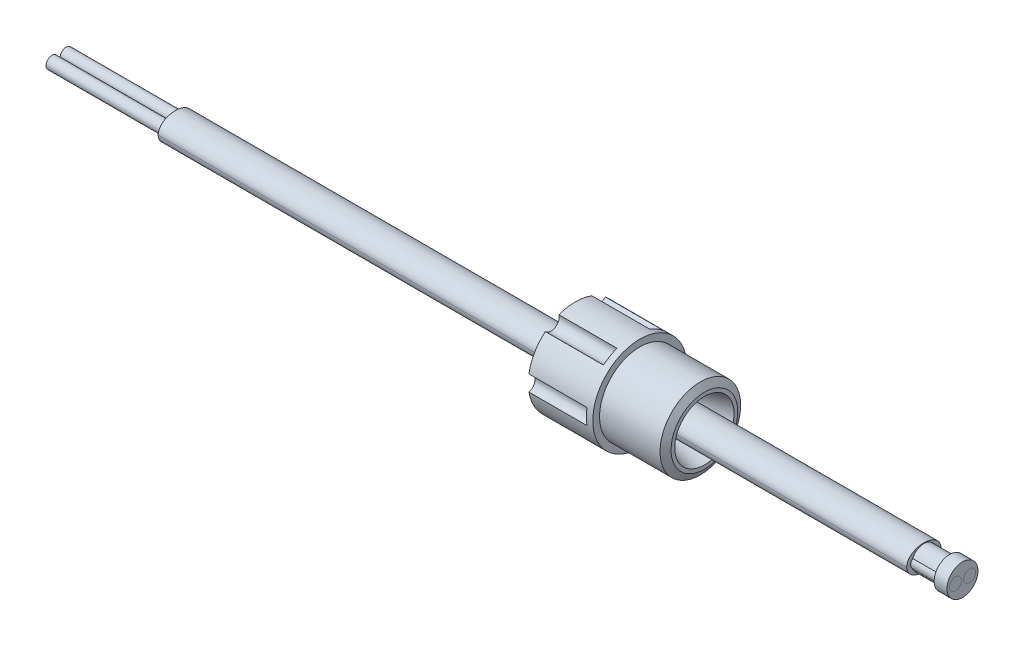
ISO-10303-21;
HEADER;
FILE_DESCRIPTION(('STEP AP214'),'2;1');
FILE_NAME('part.step','',(''),(''),'','','');
FILE_SCHEMA(('AUTOMOTIVE_DESIGN { 1 0 10303 214 1 1 1 1 }'));
ENDSEC;
DATA;
#1=APPLICATION_CONTEXT('core data for automotive mechanical design processes');
#2=APPLICATION_PROTOCOL_DEFINITION('international standard','automotive_design',2000,#1);
#3=PRODUCT_CONTEXT('',#1,'mechanical');
#4=PRODUCT('Part','Part','',(#3));
#5=PRODUCT_RELATED_PRODUCT_CATEGORY('part','',(#4));
#6=PRODUCT_DEFINITION_FORMATION('','',#4);
#7=PRODUCT_DEFINITION_CONTEXT('part definition',#1,'design');
#8=PRODUCT_DEFINITION('design','',#6,#7);
#9=PRODUCT_DEFINITION_SHAPE('','',#8);
#10=(LENGTH_UNIT() NAMED_UNIT(*) SI_UNIT(.MILLI.,.METRE.));
#11=(NAMED_UNIT(*) PLANE_ANGLE_UNIT() SI_UNIT($,.RADIAN.));
#12=(NAMED_UNIT(*) SI_UNIT($,.STERADIAN.) SOLID_ANGLE_UNIT());
#13=UNCERTAINTY_MEASURE_WITH_UNIT(LENGTH_MEASURE(1.E-05),#10,'distance_accuracy_value','');
#14=(GEOMETRIC_REPRESENTATION_CONTEXT(3) GLOBAL_UNCERTAINTY_ASSIGNED_CONTEXT((#13)) GLOBAL_UNIT_ASSIGNED_CONTEXT((#10,
#11,#12)) REPRESENTATION_CONTEXT('',''));
#15=CARTESIAN_POINT('',(0.,0.,0.));
#16=DIRECTION('',(0.,0.,1.));
#17=DIRECTION('',(1.,0.,0.));
#18=AXIS2_PLACEMENT_3D('',#15,#16,#17);
#19=CARTESIAN_POINT('',(0.,6.56336,0.));
#20=DIRECTION('',(1.,0.,0.));
#21=DIRECTION('',(0.,0.,-1.));
#22=AXIS2_PLACEMENT_3D('',#19,#20,#21);
#23=PLANE('',#22);
#24=CARTESIAN_POINT('',(0.,0.,0.));
#25=DIRECTION('',(1.,0.,0.));
#26=DIRECTION('',(0.,0.,-1.));
#27=AXIS2_PLACEMENT_3D('',#24,#25,#26);
#28=CIRCLE('',#27,5.842);
#29=CARTESIAN_POINT('',(0.,0.,-5.842));
#30=VERTEX_POINT('',#29);
#31=EDGE_CURVE('P0_E20',#30,#30,#28,.T.);
#32=ORIENTED_EDGE('',*,*,#31,.F.);
#33=EDGE_LOOP('',(#32));
#34=FACE_BOUND('',#33,.T.);
#35=CARTESIAN_POINT('',(0.,0.,0.));
#36=DIRECTION('',(-1.,0.,0.));
#37=DIRECTION('',(0.,-1.,0.));
#38=AXIS2_PLACEMENT_3D('',#35,#36,#37);
#39=CIRCLE('',#38,6.56336);
#40=CARTESIAN_POINT('',(0.,-6.56336,0.));
#41=VERTEX_POINT('',#40);
#42=EDGE_CURVE('P0_E195',#41,#41,#39,.T.);
#43=ORIENTED_EDGE('',*,*,#42,.F.);
#44=EDGE_LOOP('',(#43));
#45=FACE_BOUND('',#44,.T.);
#46=ADVANCED_FACE('P0_F17',(#34,#45),#23,.T.);
#47=CARTESIAN_POINT('',(-6.35,0.,0.));
#48=DIRECTION('',(1.,0.,0.));
#49=DIRECTION('',(0.,0.,-1.));
#50=AXIS2_PLACEMENT_3D('',#47,#48,#49);
#51=CONICAL_SURFACE('',#50,4.1405226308,0.261799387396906);
#52=CARTESIAN_POINT('',(-6.34999999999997,0.,0.));
#53=DIRECTION('',(1.,0.,0.));
#54=DIRECTION('',(0.,0.,-1.));
#55=AXIS2_PLACEMENT_3D('',#52,#53,#54);
#56=CIRCLE('',#55,4.14052263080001);
#57=CARTESIAN_POINT('',(-6.34999999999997,0.,-4.14052263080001));
#58=VERTEX_POINT('',#57);
#59=EDGE_CURVE('P0_E121',#58,#58,#56,.T.);
#60=ORIENTED_EDGE('',*,*,#59,.F.);
#61=EDGE_LOOP('',(#60));
#62=FACE_BOUND('',#61,.T.);
#63=ORIENTED_EDGE('',*,*,#31,.T.);
#64=EDGE_LOOP('',(#63));
#65=FACE_BOUND('',#64,.T.);
#66=ADVANCED_FACE('P0_F202',(#62,#65),#51,.F.);
#67=CARTESIAN_POINT('',(-0.79336011,0.,0.));
#68=DIRECTION('',(-1.,0.,0.));
#69=DIRECTION('',(0.,-1.,0.));
#70=AXIS2_PLACEMENT_3D('',#67,#68,#69);
#71=CONICAL_SURFACE('',#70,7.9375,1.04719754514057);
#72=ORIENTED_EDGE('',*,*,#42,.T.);
#73=EDGE_LOOP('',(#72));
#74=FACE_BOUND('',#73,.T.);
#75=CARTESIAN_POINT('',(-0.793360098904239,0.,0.));
#76=DIRECTION('',(-1.,0.,0.));
#77=DIRECTION('',(0.,0.,1.));
#78=AXIS2_PLACEMENT_3D('',#75,#76,#77);
#79=CIRCLE('',#78,7.9375);
#80=CARTESIAN_POINT('',(-0.793360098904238,0.,7.9375));
#81=VERTEX_POINT('',#80);
#82=EDGE_CURVE('P0_E96',#81,#81,#79,.T.);
#83=ORIENTED_EDGE('',*,*,#82,.F.);
#84=EDGE_LOOP('',(#83));
#85=FACE_BOUND('',#84,.T.);
#86=ADVANCED_FACE('P0_F211',(#74,#85),#71,.T.);
#87=CARTESIAN_POINT('',(-6.35,3.302,0.));
#88=DIRECTION('',(-1.,0.,0.));
#89=DIRECTION('',(0.,0.,1.));
#90=AXIS2_PLACEMENT_3D('',#87,#88,#89);
#91=PLANE('',#90);
#92=CARTESIAN_POINT('',(-6.35,0.,0.));
#93=DIRECTION('',(-1.,0.,0.));
#94=DIRECTION('',(0.,0.,1.));
#95=AXIS2_PLACEMENT_3D('',#92,#93,#94);
#96=CIRCLE('',#95,3.302);
#97=CARTESIAN_POINT('',(-6.35,0.,3.302));
#98=VERTEX_POINT('',#97);
#99=EDGE_CURVE('P0_E190',#98,#98,#96,.F.);
#100=ORIENTED_EDGE('',*,*,#99,.F.);
#101=EDGE_LOOP('',(#100));
#102=FACE_BOUND('',#101,.T.);
#103=ORIENTED_EDGE('',*,*,#59,.T.);
#104=EDGE_LOOP('',(#103));
#105=FACE_BOUND('',#104,.T.);
#106=ADVANCED_FACE('P0_F276',(#102,#105),#91,.F.);
#107=CARTESIAN_POINT('',(-13.97,-8.2488919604,4.7625));
#108=DIRECTION('',(-1.,0.,0.));
#109=DIRECTION('',(0.,0.,1.));
#110=AXIS2_PLACEMENT_3D('',#107,#108,#109);
#111=PLANE('',#110);
#112=CARTESIAN_POINT('',(-13.97,0.,0.));
#113=DIRECTION('',(1.,0.,0.));
#114=DIRECTION('',(0.,0.,-1.));
#115=AXIS2_PLACEMENT_3D('',#112,#113,#114);
#116=CIRCLE('',#115,9.271);
#117=CARTESIAN_POINT('',(-13.97,-7.14697163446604,5.90527200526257));
#118=VERTEX_POINT('',#117);
#119=CARTESIAN_POINT('',(-13.97,-8.68760138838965,3.2368229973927));
#120=VERTEX_POINT('',#119);
#121=EDGE_CURVE('P0_E110',#118,#120,#116,.T.);
#122=ORIENTED_EDGE('',*,*,#121,.F.);
#123=CARTESIAN_POINT('',(-13.97,-8.2488919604,4.7625));
#124=DIRECTION('',(-1.,0.,0.));
#125=DIRECTION('',(0.,0.,1.));
#126=AXIS2_PLACEMENT_3D('',#123,#124,#125);
#127=CIRCLE('',#126,1.5875);
#128=EDGE_CURVE('P0_E95',#120,#118,#127,.F.);
#129=ORIENTED_EDGE('',*,*,#128,.F.);
#130=EDGE_LOOP('',(#122,#129));
#131=FACE_BOUND('',#130,.T.);
#132=ADVANCED_FACE('P0_F273',(#131),#111,.T.);
#133=CARTESIAN_POINT('',(-13.97,-8.2488919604,-4.7625));
#134=DIRECTION('',(-1.,0.,0.));
#135=DIRECTION('',(0.,0.,1.));
#136=AXIS2_PLACEMENT_3D('',#133,#134,#135);
#137=PLANE('',#136);
#138=CARTESIAN_POINT('',(-13.97,0.,0.));
#139=DIRECTION('',(1.,0.,0.));
#140=DIRECTION('',(0.,0.,-1.));
#141=AXIS2_PLACEMENT_3D('',#138,#139,#140);
#142=CIRCLE('',#141,9.271);
#143=CARTESIAN_POINT('',(-13.97,-8.68760138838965,-3.2368229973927));
#144=VERTEX_POINT('',#143);
#145=CARTESIAN_POINT('',(-13.97,-7.14697163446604,-5.90527200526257));
#146=VERTEX_POINT('',#145);
#147=EDGE_CURVE('P0_E98',#144,#146,#142,.T.);
#148=ORIENTED_EDGE('',*,*,#147,.F.);
#149=CARTESIAN_POINT('',(-13.97,-8.2488919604,-4.7625));
#150=DIRECTION('',(-1.,0.,0.));
#151=DIRECTION('',(0.,0.,1.));
#152=AXIS2_PLACEMENT_3D('',#149,#150,#151);
#153=CIRCLE('',#152,1.5875);
#154=EDGE_CURVE('P0_E84',#146,#144,#153,.F.);
#155=ORIENTED_EDGE('',*,*,#154,.F.);
#156=EDGE_LOOP('',(#148,#155));
#157=FACE_BOUND('',#156,.T.);
#158=ADVANCED_FACE('P0_F99',(#157),#137,.T.);
#159=CARTESIAN_POINT('',(-12.7,0.,0.));
#160=DIRECTION('',(-1.,0.,0.));
#161=DIRECTION('',(0.,0.,1.));
#162=AXIS2_PLACEMENT_3D('',#159,#160,#161);
#163=CYLINDRICAL_SURFACE('',#162,7.9375);
#164=ORIENTED_EDGE('',*,*,#82,.T.);
#165=EDGE_LOOP('',(#164));
#166=FACE_BOUND('',#165,.T.);
#167=CARTESIAN_POINT('',(-12.7,0.,0.));
#168=DIRECTION('',(-1.,0.,0.));
#169=DIRECTION('',(0.,0.,1.));
#170=AXIS2_PLACEMENT_3D('',#167,#168,#169);
#171=CIRCLE('',#170,7.9375);
#172=CARTESIAN_POINT('',(-12.7,0.,7.9375));
#173=VERTEX_POINT('',#172);
#174=EDGE_CURVE('P0_E180',#173,#173,#171,.T.);
#175=ORIENTED_EDGE('',*,*,#174,.F.);
#176=EDGE_LOOP('',(#175));
#177=FACE_BOUND('',#176,.T.);
#178=ADVANCED_FACE('P0_F267',(#166,#177),#163,.T.);
#179=CARTESIAN_POINT('',(-13.97,0.,-9.525));
#180=DIRECTION('',(-1.,0.,0.));
#181=DIRECTION('',(0.,0.,1.));
#182=AXIS2_PLACEMENT_3D('',#179,#180,#181);
#183=PLANE('',#182);
#184=CARTESIAN_POINT('',(-13.97,0.,0.));
#185=DIRECTION('',(1.,0.,0.));
#186=DIRECTION('',(0.,0.,-1.));
#187=AXIS2_PLACEMENT_3D('',#184,#185,#186);
#188=CIRCLE('',#187,9.271);
#189=CARTESIAN_POINT('',(-13.97,-1.54062974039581,-9.14209500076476));
#190=VERTEX_POINT('',#189);
#191=CARTESIAN_POINT('',(-13.97,1.54062974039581,-9.14209500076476));
#192=VERTEX_POINT('',#191);
#193=EDGE_CURVE('P0_E118',#190,#192,#188,.T.);
#194=ORIENTED_EDGE('',*,*,#193,.F.);
#195=CARTESIAN_POINT('',(-13.97,0.,-9.525));
#196=DIRECTION('',(-1.,0.,0.));
#197=DIRECTION('',(0.,0.,1.));
#198=AXIS2_PLACEMENT_3D('',#195,#196,#197);
#199=CIRCLE('',#198,1.5875);
#200=EDGE_CURVE('P0_E178',#192,#190,#199,.F.);
#201=ORIENTED_EDGE('',*,*,#200,.F.);
#202=EDGE_LOOP('',(#194,#201));
#203=FACE_BOUND('',#202,.T.);
#204=ADVANCED_FACE('P0_F264',(#203),#183,.T.);
#205=CARTESIAN_POINT('',(-13.97,-8.2488919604,-4.7625));
#206=DIRECTION('',(-1.,0.,0.));
#207=DIRECTION('',(0.,0.,1.));
#208=AXIS2_PLACEMENT_3D('',#205,#206,#207);
#209=CYLINDRICAL_SURFACE('',#208,1.5875);
#210=CARTESIAN_POINT('',(-25.4,-8.2488919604,-4.7625));
#211=DIRECTION('',(-1.,0.,0.));
#212=DIRECTION('',(0.,0.,1.));
#213=AXIS2_PLACEMENT_3D('',#210,#211,#212);
#214=CIRCLE('',#213,1.5875);
#215=CARTESIAN_POINT('',(-25.4,-7.14697163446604,-5.90527200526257));
#216=VERTEX_POINT('',#215);
#217=CARTESIAN_POINT('',(-25.4,-8.68760138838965,-3.2368229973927));
#218=VERTEX_POINT('',#217);
#219=EDGE_CURVE('P0_E165',#216,#218,#214,.F.);
#220=ORIENTED_EDGE('',*,*,#219,.F.);
#221=DIRECTION('',(-1.,0.,0.));
#222=VECTOR('',#221,1.);
#223=CARTESIAN_POINT('',(-19.05,-7.14697163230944,-5.90527200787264));
#224=LINE('',#223,#222);
#225=EDGE_CURVE('P0_E92',#146,#216,#224,.T.);
#226=ORIENTED_EDGE('',*,*,#225,.F.);
#227=ORIENTED_EDGE('',*,*,#154,.T.);
#228=DIRECTION('',(1.,0.,0.));
#229=VECTOR('',#228,1.);
#230=CARTESIAN_POINT('',(-19.05,-8.68760139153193,-3.23682298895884));
#231=LINE('',#230,#229);
#232=EDGE_CURVE('P0_E89',#218,#144,#231,.T.);
#233=ORIENTED_EDGE('',*,*,#232,.F.);
#234=EDGE_LOOP('',(#220,#226,#227,#233));
#235=FACE_BOUND('',#234,.T.);
#236=ADVANCED_FACE('P0_F87',(#235),#209,.F.);
#237=CARTESIAN_POINT('',(-13.97,-8.2488919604,4.7625));
#238=DIRECTION('',(-1.,0.,0.));
#239=DIRECTION('',(0.,0.,1.));
#240=AXIS2_PLACEMENT_3D('',#237,#238,#239);
#241=CYLINDRICAL_SURFACE('',#240,1.5875);
#242=CARTESIAN_POINT('',(-25.4,-8.2488919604,4.7625));
#243=DIRECTION('',(-1.,0.,0.));
#244=DIRECTION('',(0.,0.,1.));
#245=AXIS2_PLACEMENT_3D('',#242,#243,#244);
#246=CIRCLE('',#245,1.5875);
#247=CARTESIAN_POINT('',(-25.4,-8.68760138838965,3.2368229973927));
#248=VERTEX_POINT('',#247);
#249=CARTESIAN_POINT('',(-25.4,-7.14697163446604,5.90527200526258));
#250=VERTEX_POINT('',#249);
#251=EDGE_CURVE('P0_E161',#248,#250,#246,.F.);
#252=ORIENTED_EDGE('',*,*,#251,.F.);
#253=DIRECTION('',(-1.,0.,0.));
#254=VECTOR('',#253,1.);
#255=CARTESIAN_POINT('',(-19.05,-8.68760139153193,3.23682298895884));
#256=LINE('',#255,#254);
#257=EDGE_CURVE('P0_E108',#120,#248,#256,.T.);
#258=ORIENTED_EDGE('',*,*,#257,.F.);
#259=ORIENTED_EDGE('',*,*,#128,.T.);
#260=DIRECTION('',(1.,0.,0.));
#261=VECTOR('',#260,1.);
#262=CARTESIAN_POINT('',(-19.05,-7.14697163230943,5.90527200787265));
#263=LINE('',#262,#261);
#264=EDGE_CURVE('P0_E186',#250,#118,#263,.T.);
#265=ORIENTED_EDGE('',*,*,#264,.F.);
#266=EDGE_LOOP('',(#252,#258,#259,#265));
#267=FACE_BOUND('',#266,.T.);
#268=ADVANCED_FACE('P0_F257',(#267),#241,.F.);
#269=CARTESIAN_POINT('',(-6.35,0.,0.));
#270=DIRECTION('',(-1.,0.,0.));
#271=DIRECTION('',(0.,0.,1.));
#272=AXIS2_PLACEMENT_3D('',#269,#270,#271);
#273=CYLINDRICAL_SURFACE('',#272,3.302);
#274=CARTESIAN_POINT('',(-25.4,0.,0.));
#275=DIRECTION('',(-1.,0.,0.));
#276=DIRECTION('',(0.,0.,1.));
#277=AXIS2_PLACEMENT_3D('',#274,#275,#276);
#278=CIRCLE('',#277,3.302);
#279=CARTESIAN_POINT('',(-25.4,0.,3.302));
#280=VERTEX_POINT('',#279);
#281=EDGE_CURVE('P0_E155',#280,#280,#278,.F.);
#282=ORIENTED_EDGE('',*,*,#281,.F.);
#283=EDGE_LOOP('',(#282));
#284=FACE_BOUND('',#283,.T.);
#285=ORIENTED_EDGE('',*,*,#99,.T.);
#286=EDGE_LOOP('',(#285));
#287=FACE_BOUND('',#286,.T.);
#288=ADVANCED_FACE('P0_F253',(#284,#287),#273,.F.);
#289=CARTESIAN_POINT('',(-13.97,0.,9.525));
#290=DIRECTION('',(-1.,0.,0.));
#291=DIRECTION('',(0.,0.,1.));
#292=AXIS2_PLACEMENT_3D('',#289,#290,#291);
#293=PLANE('',#292);
#294=CARTESIAN_POINT('',(-13.97,0.,0.));
#295=DIRECTION('',(1.,0.,0.));
#296=DIRECTION('',(0.,0.,-1.));
#297=AXIS2_PLACEMENT_3D('',#294,#295,#296);
#298=CIRCLE('',#297,9.271);
#299=CARTESIAN_POINT('',(-13.97,1.54062974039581,9.14209500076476));
#300=VERTEX_POINT('',#299);
#301=CARTESIAN_POINT('',(-13.97,-1.54062974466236,9.14209499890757));
#302=VERTEX_POINT('',#301);
#303=EDGE_CURVE('P0_E187',#300,#302,#298,.T.);
#304=ORIENTED_EDGE('',*,*,#303,.F.);
#305=CARTESIAN_POINT('',(-13.97,0.,9.525));
#306=DIRECTION('',(-1.,0.,0.));
#307=DIRECTION('',(0.,0.,1.));
#308=AXIS2_PLACEMENT_3D('',#305,#306,#307);
#309=CIRCLE('',#308,1.5875);
#310=EDGE_CURVE('P0_E152',#302,#300,#309,.F.);
#311=ORIENTED_EDGE('',*,*,#310,.F.);
#312=EDGE_LOOP('',(#304,#311));
#313=FACE_BOUND('',#312,.T.);
#314=ADVANCED_FACE('P0_F249',(#313),#293,.T.);
#315=CARTESIAN_POINT('',(-12.7,0.,0.));
#316=DIRECTION('',(-1.,0.,0.));
#317=DIRECTION('',(0.,0.,1.));
#318=AXIS2_PLACEMENT_3D('',#315,#316,#317);
#319=PLANE('',#318);
#320=ORIENTED_EDGE('',*,*,#174,.T.);
#321=EDGE_LOOP('',(#320));
#322=FACE_BOUND('',#321,.T.);
#323=CARTESIAN_POINT('',(-12.7,0.,0.));
#324=DIRECTION('',(1.,0.,0.));
#325=DIRECTION('',(0.,0.,-1.));
#326=AXIS2_PLACEMENT_3D('',#323,#324,#325);
#327=CIRCLE('',#326,9.271);
#328=CARTESIAN_POINT('',(-12.7,0.,-9.271));
#329=VERTEX_POINT('',#328);
#330=EDGE_CURVE('P0_E141',#329,#329,#327,.F.);
#331=ORIENTED_EDGE('',*,*,#330,.F.);
#332=EDGE_LOOP('',(#331));
#333=FACE_BOUND('',#332,.T.);
#334=ADVANCED_FACE('P0_F245',(#322,#333),#319,.F.);
#335=CARTESIAN_POINT('',(-13.97,0.,-9.525));
#336=DIRECTION('',(-1.,0.,0.));
#337=DIRECTION('',(0.,0.,1.));
#338=AXIS2_PLACEMENT_3D('',#335,#336,#337);
#339=CYLINDRICAL_SURFACE('',#338,1.5875);
#340=CARTESIAN_POINT('',(-25.4,0.,-9.525));
#341=DIRECTION('',(-1.,0.,0.));
#342=DIRECTION('',(0.,0.,1.));
#343=AXIS2_PLACEMENT_3D('',#340,#341,#342);
#344=CIRCLE('',#343,1.5875);
#345=CARTESIAN_POINT('',(-25.4,1.54062974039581,-9.14209500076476));
#346=VERTEX_POINT('',#345);
#347=CARTESIAN_POINT('',(-25.4,-1.54062974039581,-9.14209500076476));
#348=VERTEX_POINT('',#347);
#349=EDGE_CURVE('P0_E171',#346,#348,#344,.F.);
#350=ORIENTED_EDGE('',*,*,#349,.F.);
#351=DIRECTION('',(-1.,0.,0.));
#352=VECTOR('',#351,1.);
#353=CARTESIAN_POINT('',(-19.05,1.54062973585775,-9.14209500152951));
#354=LINE('',#353,#352);
#355=EDGE_CURVE('P0_E140',#192,#346,#354,.T.);
#356=ORIENTED_EDGE('',*,*,#355,.F.);
#357=ORIENTED_EDGE('',*,*,#200,.T.);
#358=DIRECTION('',(1.,0.,0.));
#359=VECTOR('',#358,1.);
#360=CARTESIAN_POINT('',(-19.05,-1.54062973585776,-9.14209500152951));
#361=LINE('',#360,#359);
#362=EDGE_CURVE('P0_E115',#348,#190,#361,.T.);
#363=ORIENTED_EDGE('',*,*,#362,.F.);
#364=EDGE_LOOP('',(#350,#356,#357,#363));
#365=FACE_BOUND('',#364,.T.);
#366=ADVANCED_FACE('P0_F241',(#365),#339,.F.);
#367=CARTESIAN_POINT('',(-13.97,8.2488919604,-4.7625));
#368=DIRECTION('',(-1.,0.,0.));
#369=DIRECTION('',(0.,0.,1.));
#370=AXIS2_PLACEMENT_3D('',#367,#368,#369);
#371=PLANE('',#370);
#372=CARTESIAN_POINT('',(-13.97,8.2488919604,-4.7625));
#373=DIRECTION('',(-1.,0.,0.));
#374=DIRECTION('',(0.,0.,1.));
#375=AXIS2_PLACEMENT_3D('',#372,#373,#374);
#376=CIRCLE('',#375,1.5875);
#377=CARTESIAN_POINT('',(-13.97,8.68760138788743,-3.23682300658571));
#378=VERTEX_POINT('',#377);
#379=CARTESIAN_POINT('',(-13.97,7.14697163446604,-5.90527200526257));
#380=VERTEX_POINT('',#379);
#381=EDGE_CURVE('P0_E145',#378,#380,#376,.F.);
#382=ORIENTED_EDGE('',*,*,#381,.F.);
#383=CARTESIAN_POINT('',(-13.97,0.,0.));
#384=DIRECTION('',(1.,0.,0.));
#385=DIRECTION('',(0.,0.,-1.));
#386=AXIS2_PLACEMENT_3D('',#383,#384,#385);
#387=CIRCLE('',#386,9.271);
#388=EDGE_CURVE('P0_E133',#380,#378,#387,.T.);
#389=ORIENTED_EDGE('',*,*,#388,.F.);
#390=EDGE_LOOP('',(#382,#389));
#391=FACE_BOUND('',#390,.T.);
#392=ADVANCED_FACE('P0_F237',(#391),#371,.T.);
#393=CARTESIAN_POINT('',(-13.97,8.2488919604,4.7625));
#394=DIRECTION('',(-1.,0.,0.));
#395=DIRECTION('',(0.,0.,1.));
#396=AXIS2_PLACEMENT_3D('',#393,#394,#395);
#397=PLANE('',#396);
#398=CARTESIAN_POINT('',(-13.97,0.,0.));
#399=DIRECTION('',(1.,0.,0.));
#400=DIRECTION('',(0.,0.,-1.));
#401=AXIS2_PLACEMENT_3D('',#398,#399,#400);
#402=CIRCLE('',#401,9.271);
#403=CARTESIAN_POINT('',(-13.97,8.68760138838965,3.2368229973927));
#404=VERTEX_POINT('',#403);
#405=CARTESIAN_POINT('',(-13.97,7.14697163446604,5.90527200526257));
#406=VERTEX_POINT('',#405);
#407=EDGE_CURVE('P0_E126',#404,#406,#402,.T.);
#408=ORIENTED_EDGE('',*,*,#407,.F.);
#409=CARTESIAN_POINT('',(-13.97,8.2488919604,4.7625));
#410=DIRECTION('',(-1.,0.,0.));
#411=DIRECTION('',(0.,0.,1.));
#412=AXIS2_PLACEMENT_3D('',#409,#410,#411);
#413=CIRCLE('',#412,1.5875);
#414=EDGE_CURVE('P0_E176',#406,#404,#413,.F.);
#415=ORIENTED_EDGE('',*,*,#414,.F.);
#416=EDGE_LOOP('',(#408,#415));
#417=FACE_BOUND('',#416,.T.);
#418=ADVANCED_FACE('P0_F233',(#417),#397,.T.);
#419=CARTESIAN_POINT('',(-13.97,8.2488919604,4.7625));
#420=DIRECTION('',(-1.,0.,0.));
#421=DIRECTION('',(0.,0.,1.));
#422=AXIS2_PLACEMENT_3D('',#419,#420,#421);
#423=CYLINDRICAL_SURFACE('',#422,1.5875);
#424=CARTESIAN_POINT('',(-25.4,8.2488919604,4.7625));
#425=DIRECTION('',(-1.,0.,0.));
#426=DIRECTION('',(0.,0.,1.));
#427=AXIS2_PLACEMENT_3D('',#424,#425,#426);
#428=CIRCLE('',#427,1.5875);
#429=CARTESIAN_POINT('',(-25.4,7.14697163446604,5.90527200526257));
#430=VERTEX_POINT('',#429);
#431=CARTESIAN_POINT('',(-25.4,8.68760138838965,3.2368229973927));
#432=VERTEX_POINT('',#431);
#433=EDGE_CURVE('P0_E174',#430,#432,#428,.F.);
#434=ORIENTED_EDGE('',*,*,#433,.F.);
#435=DIRECTION('',(-1.,0.,0.));
#436=VECTOR('',#435,1.);
#437=CARTESIAN_POINT('',(-19.05,7.14697163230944,5.90527200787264));
#438=LINE('',#437,#436);
#439=EDGE_CURVE('P0_E125',#406,#430,#438,.T.);
#440=ORIENTED_EDGE('',*,*,#439,.F.);
#441=ORIENTED_EDGE('',*,*,#414,.T.);
#442=DIRECTION('',(1.,0.,0.));
#443=VECTOR('',#442,1.);
#444=CARTESIAN_POINT('',(-19.05,8.68760139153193,3.23682298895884));
#445=LINE('',#444,#443);
#446=EDGE_CURVE('P0_E129',#432,#404,#445,.T.);
#447=ORIENTED_EDGE('',*,*,#446,.F.);
#448=EDGE_LOOP('',(#434,#440,#441,#447));
#449=FACE_BOUND('',#448,.T.);
#450=ADVANCED_FACE('P0_F229',(#449),#423,.F.);
#451=CARTESIAN_POINT('',(-25.4,0.,0.));
#452=DIRECTION('',(-1.,0.,0.));
#453=DIRECTION('',(0.,0.,1.));
#454=AXIS2_PLACEMENT_3D('',#451,#452,#453);
#455=PLANE('',#454);
#456=ORIENTED_EDGE('',*,*,#281,.T.);
#457=EDGE_LOOP('',(#456));
#458=FACE_BOUND('',#457,.T.);
#459=CARTESIAN_POINT('',(-25.4,0.,9.525));
#460=DIRECTION('',(-1.,0.,0.));
#461=DIRECTION('',(0.,0.,1.));
#462=AXIS2_PLACEMENT_3D('',#459,#460,#461);
#463=CIRCLE('',#462,1.5875);
#464=CARTESIAN_POINT('',(-25.4,1.54062974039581,9.14209500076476));
#465=VERTEX_POINT('',#464);
#466=CARTESIAN_POINT('',(-25.4,-1.54062974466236,9.14209499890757));
#467=VERTEX_POINT('',#466);
#468=EDGE_CURVE('P0_E149',#465,#467,#463,.T.);
#469=ORIENTED_EDGE('',*,*,#468,.F.);
#470=CARTESIAN_POINT('',(-25.4,0.,0.));
#471=DIRECTION('',(1.,0.,0.));
#472=DIRECTION('',(0.,0.,-1.));
#473=AXIS2_PLACEMENT_3D('',#470,#471,#472);
#474=CIRCLE('',#473,9.271);
#475=EDGE_CURVE('P0_E122',#430,#465,#474,.T.);
#476=ORIENTED_EDGE('',*,*,#475,.F.);
#477=ORIENTED_EDGE('',*,*,#433,.T.);
#478=CARTESIAN_POINT('',(-25.4,0.,0.));
#479=DIRECTION('',(1.,0.,0.));
#480=DIRECTION('',(0.,0.,-1.));
#481=AXIS2_PLACEMENT_3D('',#478,#479,#480);
#482=CIRCLE('',#481,9.271);
#483=CARTESIAN_POINT('',(-25.4,8.68760138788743,-3.23682300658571));
#484=VERTEX_POINT('',#483);
#485=EDGE_CURVE('P0_E130',#484,#432,#482,.T.);
#486=ORIENTED_EDGE('',*,*,#485,.F.);
#487=CARTESIAN_POINT('',(-25.4,8.2488919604,-4.7625));
#488=DIRECTION('',(-1.,0.,0.));
#489=DIRECTION('',(0.,0.,1.));
#490=AXIS2_PLACEMENT_3D('',#487,#488,#489);
#491=CIRCLE('',#490,1.5875);
#492=CARTESIAN_POINT('',(-25.4,7.14697163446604,-5.90527200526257));
#493=VERTEX_POINT('',#492);
#494=EDGE_CURVE('P0_E34',#493,#484,#491,.T.);
#495=ORIENTED_EDGE('',*,*,#494,.F.);
#496=CARTESIAN_POINT('',(-25.4,0.,0.));
#497=DIRECTION('',(1.,0.,0.));
#498=DIRECTION('',(0.,0.,-1.));
#499=AXIS2_PLACEMENT_3D('',#496,#497,#498);
#500=CIRCLE('',#499,9.271);
#501=EDGE_CURVE('P0_E137',#346,#493,#500,.T.);
#502=ORIENTED_EDGE('',*,*,#501,.F.);
#503=ORIENTED_EDGE('',*,*,#349,.T.);
#504=CARTESIAN_POINT('',(-25.4,0.,0.));
#505=DIRECTION('',(1.,0.,0.));
#506=DIRECTION('',(0.,0.,-1.));
#507=AXIS2_PLACEMENT_3D('',#504,#505,#506);
#508=CIRCLE('',#507,9.271);
#509=EDGE_CURVE('P0_E168',#348,#216,#508,.F.);
#510=ORIENTED_EDGE('',*,*,#509,.T.);
#511=ORIENTED_EDGE('',*,*,#219,.T.);
#512=CARTESIAN_POINT('',(-25.4,0.,0.));
#513=DIRECTION('',(1.,0.,0.));
#514=DIRECTION('',(0.,0.,-1.));
#515=AXIS2_PLACEMENT_3D('',#512,#513,#514);
#516=CIRCLE('',#515,9.271);
#517=EDGE_CURVE('P0_E107',#218,#248,#516,.F.);
#518=ORIENTED_EDGE('',*,*,#517,.T.);
#519=ORIENTED_EDGE('',*,*,#251,.T.);
#520=CARTESIAN_POINT('',(-25.4,0.,0.));
#521=DIRECTION('',(1.,0.,0.));
#522=DIRECTION('',(0.,0.,-1.));
#523=AXIS2_PLACEMENT_3D('',#520,#521,#522);
#524=CIRCLE('',#523,9.271);
#525=EDGE_CURVE('P0_E158',#250,#467,#524,.F.);
#526=ORIENTED_EDGE('',*,*,#525,.T.);
#527=EDGE_LOOP('',(#469,#476,#477,#486,#495,#502,#503,#510,#511,#518,#519,#526));
#528=FACE_BOUND('',#527,.T.);
#529=ADVANCED_FACE('P0_F225',(#458,#528),#455,.T.);
#530=CARTESIAN_POINT('',(-13.97,0.,9.525));
#531=DIRECTION('',(-1.,0.,0.));
#532=DIRECTION('',(0.,0.,1.));
#533=AXIS2_PLACEMENT_3D('',#530,#531,#532);
#534=CYLINDRICAL_SURFACE('',#533,1.5875);
#535=ORIENTED_EDGE('',*,*,#468,.T.);
#536=DIRECTION('',(1.,0.,0.));
#537=VECTOR('',#536,1.);
#538=CARTESIAN_POINT('',(-19.685,-1.54062974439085,9.14209499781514));
#539=LINE('',#538,#537);
#540=EDGE_CURVE('P0_E148',#467,#302,#539,.T.);
#541=ORIENTED_EDGE('',*,*,#540,.T.);
#542=ORIENTED_EDGE('',*,*,#310,.T.);
#543=DIRECTION('',(1.,0.,0.));
#544=VECTOR('',#543,1.);
#545=CARTESIAN_POINT('',(-19.05,1.54062973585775,9.14209500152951));
#546=LINE('',#545,#544);
#547=EDGE_CURVE('P0_E26',#465,#300,#546,.T.);
#548=ORIENTED_EDGE('',*,*,#547,.F.);
#549=EDGE_LOOP('',(#535,#541,#542,#548));
#550=FACE_BOUND('',#549,.T.);
#551=ADVANCED_FACE('P0_F220',(#550),#534,.F.);
#552=CARTESIAN_POINT('',(-12.7,0.,0.));
#553=DIRECTION('',(1.,0.,0.));
#554=DIRECTION('',(0.,0.,-1.));
#555=AXIS2_PLACEMENT_3D('',#552,#553,#554);
#556=CYLINDRICAL_SURFACE('',#555,9.271);
#557=ORIENTED_EDGE('',*,*,#547,.T.);
#558=ORIENTED_EDGE('',*,*,#303,.T.);
#559=ORIENTED_EDGE('',*,*,#540,.F.);
#560=ORIENTED_EDGE('',*,*,#525,.F.);
#561=ORIENTED_EDGE('',*,*,#264,.T.);
#562=ORIENTED_EDGE('',*,*,#121,.T.);
#563=ORIENTED_EDGE('',*,*,#257,.T.);
#564=ORIENTED_EDGE('',*,*,#517,.F.);
#565=ORIENTED_EDGE('',*,*,#232,.T.);
#566=ORIENTED_EDGE('',*,*,#147,.T.);
#567=ORIENTED_EDGE('',*,*,#225,.T.);
#568=ORIENTED_EDGE('',*,*,#509,.F.);
#569=ORIENTED_EDGE('',*,*,#362,.T.);
#570=ORIENTED_EDGE('',*,*,#193,.T.);
#571=ORIENTED_EDGE('',*,*,#355,.T.);
#572=ORIENTED_EDGE('',*,*,#501,.T.);
#573=DIRECTION('',(1.,0.,0.));
#574=VECTOR('',#573,1.);
#575=CARTESIAN_POINT('',(-19.05,7.14697163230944,-5.90527200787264));
#576=LINE('',#575,#574);
#577=EDGE_CURVE('P0_E136',#493,#380,#576,.T.);
#578=ORIENTED_EDGE('',*,*,#577,.T.);
#579=ORIENTED_EDGE('',*,*,#388,.T.);
#580=DIRECTION('',(1.,0.,0.));
#581=VECTOR('',#580,1.);
#582=CARTESIAN_POINT('',(-19.685,8.68760139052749,-3.23682300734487));
#583=LINE('',#582,#581);
#584=EDGE_CURVE('P0_E11',#484,#378,#583,.T.);
#585=ORIENTED_EDGE('',*,*,#584,.F.);
#586=ORIENTED_EDGE('',*,*,#485,.T.);
#587=ORIENTED_EDGE('',*,*,#446,.T.);
#588=ORIENTED_EDGE('',*,*,#407,.T.);
#589=ORIENTED_EDGE('',*,*,#439,.T.);
#590=ORIENTED_EDGE('',*,*,#475,.T.);
#591=EDGE_LOOP('',(#557,#558,#559,#560,#561,#562,#563,#564,#565,#566,#567,#568,#569,#570,#571,
#572,#578,#579,#585,#586,#587,#588,#589,#590));
#592=FACE_BOUND('',#591,.T.);
#593=ORIENTED_EDGE('',*,*,#330,.T.);
#594=EDGE_LOOP('',(#593));
#595=FACE_BOUND('',#594,.T.);
#596=ADVANCED_FACE('P0_F103',(#592,#595),#556,.T.);
#597=CARTESIAN_POINT('',(-13.97,8.2488919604,-4.7625));
#598=DIRECTION('',(-1.,0.,0.));
#599=DIRECTION('',(0.,0.,1.));
#600=AXIS2_PLACEMENT_3D('',#597,#598,#599);
#601=CYLINDRICAL_SURFACE('',#600,1.5875);
#602=ORIENTED_EDGE('',*,*,#494,.T.);
#603=ORIENTED_EDGE('',*,*,#584,.T.);
#604=ORIENTED_EDGE('',*,*,#381,.T.);
#605=ORIENTED_EDGE('',*,*,#577,.F.);
#606=EDGE_LOOP('',(#602,#603,#604,#605));
#607=FACE_BOUND('',#606,.T.);
#608=ADVANCED_FACE('P0_F213',(#607),#601,.F.);
#609=CLOSED_SHELL('',(#46,#66,#86,#106,#132,#158,#178,#204,#236,#268,#288,#314,#334,#366,#392,
#418,#450,#529,#551,#596,#608));
#610=MANIFOLD_SOLID_BREP('P0_B1',#609);
#611=CARTESIAN_POINT('',(48.26,0.,0.));
#612=DIRECTION('',(-1.,0.,0.));
#613=DIRECTION('',(0.,-1.,0.));
#614=AXIS2_PLACEMENT_3D('',#611,#612,#613);
#615=CYLINDRICAL_SURFACE('',#614,3.048);
#616=CARTESIAN_POINT('',(48.26,0.,0.));
#617=DIRECTION('',(-1.,0.,0.));
#618=DIRECTION('',(0.,-1.,0.));
#619=AXIS2_PLACEMENT_3D('',#616,#617,#618);
#620=CIRCLE('',#619,3.048);
#621=CARTESIAN_POINT('',(48.26,-3.048,0.));
#622=VERTEX_POINT('',#621);
#623=EDGE_CURVE('P1_E20',#622,#622,#620,.T.);
#624=ORIENTED_EDGE('',*,*,#623,.F.);
#625=EDGE_LOOP('',(#624));
#626=FACE_BOUND('',#625,.T.);
#627=CARTESIAN_POINT('',(50.8,0.,0.));
#628=DIRECTION('',(-1.,0.,0.));
#629=DIRECTION('',(0.,-1.,0.));
#630=AXIS2_PLACEMENT_3D('',#627,#628,#629);
#631=CIRCLE('',#630,3.048);
#632=CARTESIAN_POINT('',(50.8,-3.048,0.));
#633=VERTEX_POINT('',#632);
#634=EDGE_CURVE('P1_E85',#633,#633,#631,.F.);
#635=ORIENTED_EDGE('',*,*,#634,.F.);
#636=EDGE_LOOP('',(#635));
#637=FACE_BOUND('',#636,.T.);
#638=ADVANCED_FACE('P1_F17',(#626,#637),#615,.T.);
#639=CARTESIAN_POINT('',(48.26,0.,0.));
#640=DIRECTION('',(1.,0.,0.));
#641=DIRECTION('',(0.,1.,0.));
#642=AXIS2_PLACEMENT_3D('',#639,#640,#641);
#643=CYLINDRICAL_SURFACE('',#642,2.3495);
#644=CARTESIAN_POINT('',(43.18,0.,0.));
#645=DIRECTION('',(1.,0.,0.));
#646=DIRECTION('',(0.,1.,0.));
#647=AXIS2_PLACEMENT_3D('',#644,#645,#646);
#648=CIRCLE('',#647,2.3495);
#649=CARTESIAN_POINT('',(43.18,0.888716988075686,2.17493272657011));
#650=VERTEX_POINT('',#649);
#651=CARTESIAN_POINT('',(43.18,0.888716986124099,-2.17493272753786));
#652=VERTEX_POINT('',#651);
#653=EDGE_CURVE('P1_E76',#650,#652,#648,.F.);
#654=ORIENTED_EDGE('',*,*,#653,.F.);
#655=DIRECTION('',(1.,0.,0.));
#656=VECTOR('',#655,1.);
#657=CARTESIAN_POINT('',(45.72,0.888716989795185,2.17493272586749));
#658=LINE('',#657,#656);
#659=CARTESIAN_POINT('',(48.26,0.888716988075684,2.17493272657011));
#660=VERTEX_POINT('',#659);
#661=EDGE_CURVE('P1_E63',#650,#660,#658,.T.);
#662=ORIENTED_EDGE('',*,*,#661,.T.);
#663=CARTESIAN_POINT('',(48.26,0.,0.));
#664=DIRECTION('',(1.,0.,0.));
#665=DIRECTION('',(0.,1.,0.));
#666=AXIS2_PLACEMENT_3D('',#663,#664,#665);
#667=CIRCLE('',#666,2.3495);
#668=CARTESIAN_POINT('',(48.2599999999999,0.888716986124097,-2.17493272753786));
#669=VERTEX_POINT('',#668);
#670=EDGE_CURVE('P1_E71',#669,#660,#667,.T.);
#671=ORIENTED_EDGE('',*,*,#670,.F.);
#672=DIRECTION('',(1.,0.,0.));
#673=VECTOR('',#672,1.);
#674=CARTESIAN_POINT('',(46.99,0.888716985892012,-2.174932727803));
#675=LINE('',#674,#673);
#676=EDGE_CURVE('P1_E91',#652,#669,#675,.T.);
#677=ORIENTED_EDGE('',*,*,#676,.F.);
#678=EDGE_LOOP('',(#654,#662,#671,#677));
#679=FACE_BOUND('',#678,.T.);
#680=ADVANCED_FACE('P1_F74',(#679),#643,.T.);
#681=CARTESIAN_POINT('',(48.26,0.,0.));
#682=DIRECTION('',(1.,0.,0.));
#683=DIRECTION('',(0.,0.,-1.));
#684=AXIS2_PLACEMENT_3D('',#681,#682,#683);
#685=PLANE('',#684);
#686=ORIENTED_EDGE('',*,*,#670,.T.);
#687=CARTESIAN_POINT('',(48.2600000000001,0.,1.397));
#688=DIRECTION('',(1.,0.,0.));
#689=DIRECTION('',(0.,0.,-1.));
#690=AXIS2_PLACEMENT_3D('',#687,#688,#689);
#691=CIRCLE('',#690,1.1811);
#692=CARTESIAN_POINT('',(48.2600000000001,-0.888716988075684,2.17493272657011));
#693=VERTEX_POINT('',#692);
#694=EDGE_CURVE('P1_E60',#693,#660,#691,.F.);
#695=ORIENTED_EDGE('',*,*,#694,.F.);
#696=CARTESIAN_POINT('',(48.26,0.,0.));
#697=DIRECTION('',(1.,0.,0.));
#698=DIRECTION('',(0.,1.,0.));
#699=AXIS2_PLACEMENT_3D('',#696,#697,#698);
#700=CIRCLE('',#699,2.3495);
#701=CARTESIAN_POINT('',(48.26,-0.888716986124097,-2.17493272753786));
#702=VERTEX_POINT('',#701);
#703=EDGE_CURVE('P1_E95',#702,#693,#700,.F.);
#704=ORIENTED_EDGE('',*,*,#703,.F.);
#705=CARTESIAN_POINT('',(48.2599999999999,0.,-1.397));
#706=DIRECTION('',(1.,0.,0.));
#707=DIRECTION('',(0.,0.,-1.));
#708=AXIS2_PLACEMENT_3D('',#705,#706,#707);
#709=CIRCLE('',#708,1.1811);
#710=EDGE_CURVE('P1_E32',#669,#702,#709,.F.);
#711=ORIENTED_EDGE('',*,*,#710,.F.);
#712=EDGE_LOOP('',(#686,#695,#704,#711));
#713=FACE_BOUND('',#712,.T.);
#714=ORIENTED_EDGE('',*,*,#623,.T.);
#715=EDGE_LOOP('',(#714));
#716=FACE_BOUND('',#715,.T.);
#717=ADVANCED_FACE('P1_F79',(#713,#716),#685,.F.);
#718=CARTESIAN_POINT('',(43.18,0.,1.397));
#719=DIRECTION('',(1.,0.,0.));
#720=DIRECTION('',(0.,0.,-1.));
#721=AXIS2_PLACEMENT_3D('',#718,#719,#720);
#722=CYLINDRICAL_SURFACE('',#721,1.1811);
#723=CARTESIAN_POINT('',(50.8,0.,1.397));
#724=DIRECTION('',(1.,0.,0.));
#725=DIRECTION('',(0.,0.,-1.));
#726=AXIS2_PLACEMENT_3D('',#723,#724,#725);
#727=CIRCLE('',#726,1.1811);
#728=CARTESIAN_POINT('',(50.8,0.,0.2159));
#729=VERTEX_POINT('',#728);
#730=EDGE_CURVE('P1_E88',#729,#729,#727,.F.);
#731=ORIENTED_EDGE('',*,*,#730,.F.);
#732=EDGE_LOOP('',(#731));
#733=FACE_BOUND('',#732,.T.);
#734=CARTESIAN_POINT('',(43.18,0.,1.397));
#735=DIRECTION('',(1.,0.,0.));
#736=DIRECTION('',(0.,0.,-1.));
#737=AXIS2_PLACEMENT_3D('',#734,#735,#736);
#738=CIRCLE('',#737,1.1811);
#739=CARTESIAN_POINT('',(43.18,-0.888716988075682,2.17493272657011));
#740=VERTEX_POINT('',#739);
#741=EDGE_CURVE('P1_E70',#740,#650,#738,.T.);
#742=ORIENTED_EDGE('',*,*,#741,.F.);
#743=DIRECTION('',(-1.,0.,0.));
#744=VECTOR('',#743,1.);
#745=CARTESIAN_POINT('',(45.72,-0.888716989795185,2.17493272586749));
#746=LINE('',#745,#744);
#747=EDGE_CURVE('P1_E66',#693,#740,#746,.T.);
#748=ORIENTED_EDGE('',*,*,#747,.F.);
#749=ORIENTED_EDGE('',*,*,#694,.T.);
#750=ORIENTED_EDGE('',*,*,#661,.F.);
#751=EDGE_LOOP('',(#742,#748,#749,#750));
#752=FACE_BOUND('',#751,.T.);
#753=ADVANCED_FACE('P1_F62',(#733,#752),#722,.F.);
#754=CARTESIAN_POINT('',(43.18,0.,0.));
#755=DIRECTION('',(-1.,0.,0.));
#756=DIRECTION('',(0.,0.,1.));
#757=AXIS2_PLACEMENT_3D('',#754,#755,#756);
#758=PLANE('',#757);
#759=ORIENTED_EDGE('',*,*,#741,.T.);
#760=ORIENTED_EDGE('',*,*,#653,.T.);
#761=CARTESIAN_POINT('',(43.18,0.,-1.397));
#762=DIRECTION('',(1.,0.,0.));
#763=DIRECTION('',(0.,0.,-1.));
#764=AXIS2_PLACEMENT_3D('',#761,#762,#763);
#765=CIRCLE('',#764,1.1811);
#766=CARTESIAN_POINT('',(43.18,-0.888716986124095,-2.17493272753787));
#767=VERTEX_POINT('',#766);
#768=EDGE_CURVE('P1_E41',#767,#652,#765,.F.);
#769=ORIENTED_EDGE('',*,*,#768,.F.);
#770=CARTESIAN_POINT('',(43.18,0.,0.));
#771=DIRECTION('',(1.,0.,0.));
#772=DIRECTION('',(0.,1.,0.));
#773=AXIS2_PLACEMENT_3D('',#770,#771,#772);
#774=CIRCLE('',#773,2.3495);
#775=EDGE_CURVE('P1_E93',#740,#767,#774,.T.);
#776=ORIENTED_EDGE('',*,*,#775,.F.);
#777=EDGE_LOOP('',(#759,#760,#769,#776));
#778=FACE_BOUND('',#777,.T.);
#779=ADVANCED_FACE('P1_F105',(#778),#758,.T.);
#780=CARTESIAN_POINT('',(50.8,0.,0.));
#781=DIRECTION('',(1.,0.,0.));
#782=DIRECTION('',(0.,0.,-1.));
#783=AXIS2_PLACEMENT_3D('',#780,#781,#782);
#784=PLANE('',#783);
#785=ORIENTED_EDGE('',*,*,#730,.T.);
#786=EDGE_LOOP('',(#785));
#787=FACE_BOUND('',#786,.T.);
#788=CARTESIAN_POINT('',(50.8,0.,-1.397));
#789=DIRECTION('',(1.,0.,0.));
#790=DIRECTION('',(0.,0.,-1.));
#791=AXIS2_PLACEMENT_3D('',#788,#789,#790);
#792=CIRCLE('',#791,1.1811);
#793=CARTESIAN_POINT('',(50.8,0.,-2.5781));
#794=VERTEX_POINT('',#793);
#795=EDGE_CURVE('P1_E25',#794,#794,#792,.T.);
#796=ORIENTED_EDGE('',*,*,#795,.F.);
#797=EDGE_LOOP('',(#796));
#798=FACE_BOUND('',#797,.T.);
#799=ORIENTED_EDGE('',*,*,#634,.T.);
#800=EDGE_LOOP('',(#799));
#801=FACE_BOUND('',#800,.T.);
#802=ADVANCED_FACE('P1_F107',(#787,#798,#801),#784,.T.);
#803=CARTESIAN_POINT('',(48.26,0.,0.));
#804=DIRECTION('',(1.,0.,0.));
#805=DIRECTION('',(0.,1.,0.));
#806=AXIS2_PLACEMENT_3D('',#803,#804,#805);
#807=CYLINDRICAL_SURFACE('',#806,2.3495);
#808=ORIENTED_EDGE('',*,*,#703,.T.);
#809=ORIENTED_EDGE('',*,*,#747,.T.);
#810=ORIENTED_EDGE('',*,*,#775,.T.);
#811=DIRECTION('',(-1.,0.,0.));
#812=VECTOR('',#811,1.);
#813=CARTESIAN_POINT('',(46.99,-0.888716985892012,-2.174932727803));
#814=LINE('',#813,#812);
#815=EDGE_CURVE('P1_E11',#702,#767,#814,.T.);
#816=ORIENTED_EDGE('',*,*,#815,.F.);
#817=EDGE_LOOP('',(#808,#809,#810,#816));
#818=FACE_BOUND('',#817,.T.);
#819=ADVANCED_FACE('P1_F102',(#818),#807,.T.);
#820=CARTESIAN_POINT('',(43.18,0.,-1.397));
#821=DIRECTION('',(1.,0.,0.));
#822=DIRECTION('',(0.,0.,-1.));
#823=AXIS2_PLACEMENT_3D('',#820,#821,#822);
#824=CYLINDRICAL_SURFACE('',#823,1.1811);
#825=ORIENTED_EDGE('',*,*,#795,.T.);
#826=EDGE_LOOP('',(#825));
#827=FACE_BOUND('',#826,.T.);
#828=ORIENTED_EDGE('',*,*,#710,.T.);
#829=ORIENTED_EDGE('',*,*,#815,.T.);
#830=ORIENTED_EDGE('',*,*,#768,.T.);
#831=ORIENTED_EDGE('',*,*,#676,.T.);
#832=EDGE_LOOP('',(#828,#829,#830,#831));
#833=FACE_BOUND('',#832,.T.);
#834=ADVANCED_FACE('P1_F104',(#827,#833),#824,.F.);
#835=CLOSED_SHELL('',(#638,#680,#717,#753,#779,#802,#819,#834));
#836=MANIFOLD_SOLID_BREP('P1_B1',#835);
#837=CARTESIAN_POINT('',(-127.,0.,-1.397));
#838=DIRECTION('',(-1.,0.,0.));
#839=DIRECTION('',(0.,0.,1.));
#840=AXIS2_PLACEMENT_3D('',#837,#838,#839);
#841=PLANE('',#840);
#842=CARTESIAN_POINT('',(-127.,0.,-1.397));
#843=DIRECTION('',(1.,0.,0.));
#844=DIRECTION('',(0.,0.,-1.));
#845=AXIS2_PLACEMENT_3D('',#842,#843,#844);
#846=CIRCLE('',#845,1.1811);
#847=CARTESIAN_POINT('',(-127.,0.,-2.5781));
#848=VERTEX_POINT('',#847);
#849=EDGE_CURVE('P2_E18',#848,#848,#846,.T.);
#850=ORIENTED_EDGE('',*,*,#849,.F.);
#851=EDGE_LOOP('',(#850));
#852=FACE_BOUND('',#851,.T.);
#853=ADVANCED_FACE('P2_F15',(#852),#841,.T.);
#854=CARTESIAN_POINT('',(50.8,0.,-1.397));
#855=DIRECTION('',(-1.,0.,0.));
#856=DIRECTION('',(0.,0.,1.));
#857=AXIS2_PLACEMENT_3D('',#854,#855,#856);
#858=PLANE('',#857);
#859=CARTESIAN_POINT('',(50.8,0.,-1.397));
#860=DIRECTION('',(1.,0.,0.));
#861=DIRECTION('',(0.,0.,-1.));
#862=AXIS2_PLACEMENT_3D('',#859,#860,#861);
#863=CIRCLE('',#862,1.1811);
#864=CARTESIAN_POINT('',(50.8,0.,-2.5781));
#865=VERTEX_POINT('',#864);
#866=EDGE_CURVE('P2_E10',#865,#865,#863,.F.);
#867=ORIENTED_EDGE('',*,*,#866,.F.);
#868=EDGE_LOOP('',(#867));
#869=FACE_BOUND('',#868,.T.);
#870=ADVANCED_FACE('P2_F30',(#869),#858,.F.);
#871=CARTESIAN_POINT('',(50.8,0.,-1.397));
#872=DIRECTION('',(1.,0.,0.));
#873=DIRECTION('',(0.,0.,-1.));
#874=AXIS2_PLACEMENT_3D('',#871,#872,#873);
#875=CYLINDRICAL_SURFACE('',#874,1.1811);
#876=ORIENTED_EDGE('',*,*,#866,.T.);
#877=EDGE_LOOP('',(#876));
#878=FACE_BOUND('',#877,.T.);
#879=ORIENTED_EDGE('',*,*,#849,.T.);
#880=EDGE_LOOP('',(#879));
#881=FACE_BOUND('',#880,.T.);
#882=ADVANCED_FACE('P2_F27',(#878,#881),#875,.T.);
#883=CLOSED_SHELL('',(#853,#870,#882));
#884=MANIFOLD_SOLID_BREP('P2_B1',#883);
#885=CARTESIAN_POINT('',(-127.,0.,1.397));
#886=DIRECTION('',(-1.,0.,0.));
#887=DIRECTION('',(0.,0.,1.));
#888=AXIS2_PLACEMENT_3D('',#885,#886,#887);
#889=PLANE('',#888);
#890=CARTESIAN_POINT('',(-127.,0.,1.397));
#891=DIRECTION('',(1.,0.,0.));
#892=DIRECTION('',(0.,0.,-1.));
#893=AXIS2_PLACEMENT_3D('',#890,#891,#892);
#894=CIRCLE('',#893,1.1811);
#895=CARTESIAN_POINT('',(-127.,0.,0.2159));
#896=VERTEX_POINT('',#895);
#897=EDGE_CURVE('P3_E18',#896,#896,#894,.T.);
#898=ORIENTED_EDGE('',*,*,#897,.F.);
#899=EDGE_LOOP('',(#898));
#900=FACE_BOUND('',#899,.T.);
#901=ADVANCED_FACE('P3_F15',(#900),#889,.T.);
#902=CARTESIAN_POINT('',(50.8,0.,1.397));
#903=DIRECTION('',(-1.,0.,0.));
#904=DIRECTION('',(0.,0.,1.));
#905=AXIS2_PLACEMENT_3D('',#902,#903,#904);
#906=PLANE('',#905);
#907=CARTESIAN_POINT('',(50.8,0.,1.397));
#908=DIRECTION('',(1.,0.,0.));
#909=DIRECTION('',(0.,0.,-1.));
#910=AXIS2_PLACEMENT_3D('',#907,#908,#909);
#911=CIRCLE('',#910,1.1811);
#912=CARTESIAN_POINT('',(50.8,0.,0.2159));
#913=VERTEX_POINT('',#912);
#914=EDGE_CURVE('P3_E10',#913,#913,#911,.F.);
#915=ORIENTED_EDGE('',*,*,#914,.F.);
#916=EDGE_LOOP('',(#915));
#917=FACE_BOUND('',#916,.T.);
#918=ADVANCED_FACE('P3_F30',(#917),#906,.F.);
#919=CARTESIAN_POINT('',(50.8,0.,1.397));
#920=DIRECTION('',(1.,0.,0.));
#921=DIRECTION('',(0.,0.,-1.));
#922=AXIS2_PLACEMENT_3D('',#919,#920,#921);
#923=CYLINDRICAL_SURFACE('',#922,1.1811);
#924=ORIENTED_EDGE('',*,*,#914,.T.);
#925=EDGE_LOOP('',(#924));
#926=FACE_BOUND('',#925,.T.);
#927=ORIENTED_EDGE('',*,*,#897,.T.);
#928=EDGE_LOOP('',(#927));
#929=FACE_BOUND('',#928,.T.);
#930=ADVANCED_FACE('P3_F27',(#926,#929),#923,.T.);
#931=CLOSED_SHELL('',(#901,#918,#930));
#932=MANIFOLD_SOLID_BREP('P3_B1',#931);
#933=CARTESIAN_POINT('',(-104.14,0.,3.3655));
#934=CARTESIAN_POINT('',(43.18,0.,3.3655));
#935=CARTESIAN_POINT('',(-104.14,0.3749733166,3.3655));
#936=CARTESIAN_POINT('',(43.18,0.3749733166,3.3655));
#937=CARTESIAN_POINT('',(-104.14,1.1249199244,3.1260383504));
#938=CARTESIAN_POINT('',(43.18,1.1249199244,3.1260383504));
#939=CARTESIAN_POINT('',(-104.14,1.9074458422,2.2972850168));
#940=CARTESIAN_POINT('',(43.18,1.9074458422,2.2972850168));
#941=CARTESIAN_POINT('',(-104.14,2.3752778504,1.2154888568));
#942=CARTESIAN_POINT('',(43.18,2.3752778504,1.2154888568));
#943=CARTESIAN_POINT('',(-104.14,2.5321789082,0.));
#944=CARTESIAN_POINT('',(43.18,2.5321789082,0.));
#945=CARTESIAN_POINT('',(-104.14,2.3752778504,-1.2154888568));
#946=CARTESIAN_POINT('',(43.18,2.3752778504,-1.2154888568));
#947=CARTESIAN_POINT('',(-104.14,1.9074458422,-2.2972850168));
#948=CARTESIAN_POINT('',(43.18,1.9074458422,-2.2972850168));
#949=CARTESIAN_POINT('',(-104.14,1.1249199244,-3.1260383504));
#950=CARTESIAN_POINT('',(43.18,1.1249199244,-3.1260383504));
#951=CARTESIAN_POINT('',(-104.14,0.3749733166,-3.3655));
#952=CARTESIAN_POINT('',(43.18,0.3749733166,-3.3655));
#953=CARTESIAN_POINT('',(-104.14,0.,-3.3655));
#954=CARTESIAN_POINT('',(43.18,0.,-3.3655));
#955=B_SPLINE_SURFACE_WITH_KNOTS('',3,1,((#933,#934),(#935,#936),(#937,#938),(#939,#940),(#941,
#942),(#943,#944),(#945,#946),(#947,#948),(#949,#950),(#951,#952),(#953,#954)),.UNSPECIFIED.,
.F.,.F.,.F.,(4,1,1,1,1,1,1,1,4),(2,2),(0.,0.392699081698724,0.785398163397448,1.17809724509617,
1.5707963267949,1.96349540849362,2.35619449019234,2.74889357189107,3.14159265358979),(0.,1.),.UNSPECIFIED.);
#956=DIRECTION('',(1.,0.,0.));
#957=VECTOR('',#956,1.);
#958=CARTESIAN_POINT('',(-30.48,0.,3.3655));
#959=LINE('',#958,#957);
#960=CARTESIAN_POINT('',(43.18,0.,3.3655));
#961=VERTEX_POINT('',#960);
#962=CARTESIAN_POINT('',(-104.14,0.,3.3655));
#963=VERTEX_POINT('',#962);
#964=EDGE_CURVE('P4_E69',#961,#963,#959,.F.);
#965=CARTESIAN_POINT('',(43.18,0.,-3.3655));
#966=CARTESIAN_POINT('',(43.18,0.112362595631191,-3.36548135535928));
#967=CARTESIAN_POINT('',(43.18,0.224450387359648,-3.35475169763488));
#968=CARTESIAN_POINT('',(43.18,0.44481878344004,-3.31431119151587));
#969=CARTESIAN_POINT('',(43.18,0.55311072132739,-3.28466303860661));
#970=CARTESIAN_POINT('',(43.18,0.710705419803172,-3.22780834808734));
#971=CARTESIAN_POINT('',(43.18,0.762369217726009,-3.20682641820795));
#972=CARTESIAN_POINT('',(43.18,0.863933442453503,-3.16093947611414));
#973=CARTESIAN_POINT('',(43.18,0.913834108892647,-3.13603499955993));
#974=CARTESIAN_POINT('',(43.18,1.0115902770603,-3.08247376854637));
#975=CARTESIAN_POINT('',(43.18,1.05944535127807,-3.0538162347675));
#976=CARTESIAN_POINT('',(43.18,1.15282793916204,-2.99294498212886));
#977=CARTESIAN_POINT('',(43.18,1.19835532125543,-2.96073106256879));
#978=CARTESIAN_POINT('',(43.18,1.33972280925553,-2.85274644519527));
#979=CARTESIAN_POINT('',(43.18,1.43091298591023,-2.77079026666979));
#980=CARTESIAN_POINT('',(43.18,1.60086640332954,-2.5948938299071));
#981=CARTESIAN_POINT('',(43.18,1.67961312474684,-2.50093793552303));
#982=CARTESIAN_POINT('',(43.18,1.80969340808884,-2.32514305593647));
#983=CARTESIAN_POINT('',(43.18,1.86329886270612,-2.24496037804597));
#984=CARTESIAN_POINT('',(43.18,1.96339833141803,-2.08026280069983));
#985=CARTESIAN_POINT('',(43.18,2.0098894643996,-1.99574616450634));
#986=CARTESIAN_POINT('',(43.18,2.13899560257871,-1.73672843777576));
#987=CARTESIAN_POINT('',(43.18,2.21114107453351,-1.55690178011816));
#988=CARTESIAN_POINT('',(43.18,2.30842689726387,-1.25397135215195));
#989=CARTESIAN_POINT('',(43.18,2.34117439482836,-1.13317392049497));
#990=CARTESIAN_POINT('',(43.18,2.39620903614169,-0.889194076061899));
#991=CARTESIAN_POINT('',(43.18,2.41849283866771,-0.766010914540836));
#992=CARTESIAN_POINT('',(43.18,2.47016127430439,-0.394126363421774));
#993=CARTESIAN_POINT('',(43.18,2.48435802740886,-0.143105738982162));
#994=CARTESIAN_POINT('',(43.18,2.47577657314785,0.233739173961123));
#995=CARTESIAN_POINT('',(43.18,2.46780089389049,0.360144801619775));
#996=CARTESIAN_POINT('',(43.18,2.4415421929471,0.611957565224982));
#997=CARTESIAN_POINT('',(43.18,2.42325739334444,0.737364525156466));
#998=CARTESIAN_POINT('',(43.18,2.37613789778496,0.986016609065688));
#999=CARTESIAN_POINT('',(43.18,2.347316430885,1.10926424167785));
#1000=CARTESIAN_POINT('',(43.18,2.27868782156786,1.35264579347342));
#1001=CARTESIAN_POINT('',(43.18,2.2388858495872,1.47278114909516));
#1002=CARTESIAN_POINT('',(43.18,2.16174858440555,1.67238842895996));
#1003=CARTESIAN_POINT('',(43.18,2.12740544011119,1.75302421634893));
#1004=CARTESIAN_POINT('',(43.18,2.05300126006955,1.91162533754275));
#1005=CARTESIAN_POINT('',(43.18,2.01294038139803,1.98959074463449));
#1006=CARTESIAN_POINT('',(43.18,1.92701273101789,2.14212887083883));
#1007=CARTESIAN_POINT('',(43.18,1.88115421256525,2.21670621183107));
#1008=CARTESIAN_POINT('',(43.18,1.7835089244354,2.36183005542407));
#1009=CARTESIAN_POINT('',(43.18,1.73172358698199,2.43237752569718));
#1010=CARTESIAN_POINT('',(43.18,1.59246702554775,2.60490871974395));
#1011=CARTESIAN_POINT('',(43.18,1.50070715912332,2.70356075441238));
#1012=CARTESIAN_POINT('',(43.18,1.35198494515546,2.83925850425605));
#1013=CARTESIAN_POINT('',(43.18,1.3005471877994,2.88245517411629));
#1014=CARTESIAN_POINT('',(43.18,1.19407894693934,2.96419582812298));
#1015=CARTESIAN_POINT('',(43.18,1.13904880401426,3.00274025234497));
#1016=CARTESIAN_POINT('',(43.18,1.02519786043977,3.07488940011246));
#1017=CARTESIAN_POINT('',(43.18,0.966349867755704,3.10845139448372));
#1018=CARTESIAN_POINT('',(43.18,0.845809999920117,3.16996536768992));
#1019=CARTESIAN_POINT('',(43.18,0.784117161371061,3.19791542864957));
#1020=CARTESIAN_POINT('',(43.18,0.595654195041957,3.27271581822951));
#1021=CARTESIAN_POINT('',(43.18,0.46512811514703,3.31075255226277));
#1022=CARTESIAN_POINT('',(43.18,0.277457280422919,3.34495242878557));
#1023=CARTESIAN_POINT('',(43.18,0.222213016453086,3.35258908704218));
#1024=CARTESIAN_POINT('',(43.18,0.111334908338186,3.36285716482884));
#1025=CARTESIAN_POINT('',(43.18,0.0557016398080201,3.36549485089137));
#1026=CARTESIAN_POINT('',(43.18,0.,3.3655));
#1027=B_SPLINE_CURVE_WITH_KNOTS('',3,(#965,#966,#967,#968,#969,#970,#971,#972,#973,#974,#975,
#976,#977,#978,#979,#980,#981,#982,#983,#984,#985,#986,#987,#988,#989,#990,#991,#992,#993,#994,
#995,#996,#997,#998,#999,#1000,#1001,#1002,#1003,#1004,#1005,#1006,#1007,#1008,#1009,#1010,
#1011,#1012,#1013,#1014,#1015,#1016,#1017,#1018,#1019,#1020,#1021,#1022,#1023,#1024,#1025,
#1026),.UNSPECIFIED.,.F.,.F.,(4,2,2,2,2,2,2,2,2,2,2,2,2,2,2,2,2,2,2,2,2,2,2,2,2,2,2,2,2,2,4),
(0.,0.336248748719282,0.671388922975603,0.838548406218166,1.0056850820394,1.17285651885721,
1.34003739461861,1.70630957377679,2.07306398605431,2.36203553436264,2.65112380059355,
3.22981956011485,3.60488439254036,3.98006890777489,4.7304870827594,5.11015235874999,
5.4898831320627,5.86913877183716,6.24821613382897,6.510949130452,6.77367491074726,
7.03603081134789,7.29832344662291,7.70068999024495,7.90199069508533,8.10327234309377,
8.3061911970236,8.50917928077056,8.91385330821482,9.08098323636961,9.24790351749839),.UNSPECIFIED.);
#1028=CARTESIAN_POINT('',(43.18,0.,-3.3655));
#1029=VERTEX_POINT('',#1028);
#1030=EDGE_CURVE('P4_E65',#1029,#961,#1027,.T.);
#1031=DIRECTION('',(-1.,0.,0.));
#1032=VECTOR('',#1031,1.);
#1033=CARTESIAN_POINT('',(-30.48,0.,-3.3655));
#1034=LINE('',#1033,#1032);
#1035=CARTESIAN_POINT('',(-104.14,0.,-3.3655));
#1036=VERTEX_POINT('',#1035);
#1037=EDGE_CURVE('P4_E62',#1036,#1029,#1034,.F.);
#1038=CARTESIAN_POINT('',(-104.14,0.,3.3655));
#1039=CARTESIAN_POINT('',(-104.14,0.112362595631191,3.36548135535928));
#1040=CARTESIAN_POINT('',(-104.14,0.224450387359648,3.35475169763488));
#1041=CARTESIAN_POINT('',(-104.14,0.44481878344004,3.31431119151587));
#1042=CARTESIAN_POINT('',(-104.14,0.55311072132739,3.28466303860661));
#1043=CARTESIAN_POINT('',(-104.14,0.710705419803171,3.22780834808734));
#1044=CARTESIAN_POINT('',(-104.14,0.762369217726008,3.20682641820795));
#1045=CARTESIAN_POINT('',(-104.14,0.863933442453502,3.16093947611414));
#1046=CARTESIAN_POINT('',(-104.14,0.913834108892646,3.13603499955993));
#1047=CARTESIAN_POINT('',(-104.14,1.0115902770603,3.08247376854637));
#1048=CARTESIAN_POINT('',(-104.14,1.05944535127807,3.0538162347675));
#1049=CARTESIAN_POINT('',(-104.14,1.15282793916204,2.99294498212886));
#1050=CARTESIAN_POINT('',(-104.14,1.19835532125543,2.96073106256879));
#1051=CARTESIAN_POINT('',(-104.14,1.33972280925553,2.85274644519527));
#1052=CARTESIAN_POINT('',(-104.14,1.43091298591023,2.77079026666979));
#1053=CARTESIAN_POINT('',(-104.14,1.60086640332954,2.5948938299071));
#1054=CARTESIAN_POINT('',(-104.14,1.67961312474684,2.50093793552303));
#1055=CARTESIAN_POINT('',(-104.14,1.80969340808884,2.32514305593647));
#1056=CARTESIAN_POINT('',(-104.14,1.86329886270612,2.24496037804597));
#1057=CARTESIAN_POINT('',(-104.14,1.96339833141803,2.08026280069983));
#1058=CARTESIAN_POINT('',(-104.14,2.0098894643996,1.99574616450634));
#1059=CARTESIAN_POINT('',(-104.14,2.13899560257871,1.73672843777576));
#1060=CARTESIAN_POINT('',(-104.14,2.21114107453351,1.55690178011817));
#1061=CARTESIAN_POINT('',(-104.14,2.30842689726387,1.25397135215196));
#1062=CARTESIAN_POINT('',(-104.14,2.34117439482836,1.13317392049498));
#1063=CARTESIAN_POINT('',(-104.14,2.39620903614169,0.889194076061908));
#1064=CARTESIAN_POINT('',(-104.14,2.41849283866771,0.766010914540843));
#1065=CARTESIAN_POINT('',(-104.14,2.47016127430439,0.394126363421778));
#1066=CARTESIAN_POINT('',(-104.14,2.48435802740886,0.143105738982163));
#1067=CARTESIAN_POINT('',(-104.14,2.47577657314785,-0.233739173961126));
#1068=CARTESIAN_POINT('',(-104.14,2.46780089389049,-0.360144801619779));
#1069=CARTESIAN_POINT('',(-104.14,2.4415421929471,-0.611957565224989));
#1070=CARTESIAN_POINT('',(-104.14,2.42325739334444,-0.737364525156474));
#1071=CARTESIAN_POINT('',(-104.14,2.37613789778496,-0.9860166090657));
#1072=CARTESIAN_POINT('',(-104.14,2.347316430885,-1.10926424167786));
#1073=CARTESIAN_POINT('',(-104.14,2.27868782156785,-1.35264579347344));
#1074=CARTESIAN_POINT('',(-104.14,2.2388858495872,-1.47278114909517));
#1075=CARTESIAN_POINT('',(-104.14,2.16174858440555,-1.67238842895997));
#1076=CARTESIAN_POINT('',(-104.14,2.12740544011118,-1.75302421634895));
#1077=CARTESIAN_POINT('',(-104.14,2.05300126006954,-1.91162533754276));
#1078=CARTESIAN_POINT('',(-104.14,2.01294038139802,-1.9895907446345));
#1079=CARTESIAN_POINT('',(-104.14,1.92701273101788,-2.14212887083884));
#1080=CARTESIAN_POINT('',(-104.14,1.88115421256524,-2.21670621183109));
#1081=CARTESIAN_POINT('',(-104.14,1.78350892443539,-2.36183005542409));
#1082=CARTESIAN_POINT('',(-104.14,1.73172358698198,-2.4323775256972));
#1083=CARTESIAN_POINT('',(-104.14,1.59246702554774,-2.60490871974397));
#1084=CARTESIAN_POINT('',(-104.14,1.50070715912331,-2.70356075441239));
#1085=CARTESIAN_POINT('',(-104.14,1.35198494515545,-2.83925850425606));
#1086=CARTESIAN_POINT('',(-104.14,1.30054718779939,-2.8824551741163));
#1087=CARTESIAN_POINT('',(-104.14,1.19407894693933,-2.96419582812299));
#1088=CARTESIAN_POINT('',(-104.14,1.13904880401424,-3.00274025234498));
#1089=CARTESIAN_POINT('',(-104.14,1.02519786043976,-3.07488940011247));
#1090=CARTESIAN_POINT('',(-104.14,0.966349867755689,-3.10845139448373));
#1091=CARTESIAN_POINT('',(-104.14,0.845809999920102,-3.16996536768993));
#1092=CARTESIAN_POINT('',(-104.14,0.784117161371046,-3.19791542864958));
#1093=CARTESIAN_POINT('',(-104.14,0.595654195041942,-3.27271581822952));
#1094=CARTESIAN_POINT('',(-104.14,0.465128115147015,-3.31075255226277));
#1095=CARTESIAN_POINT('',(-104.14,0.277457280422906,-3.34495242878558));
#1096=CARTESIAN_POINT('',(-104.14,0.222213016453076,-3.35258908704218));
#1097=CARTESIAN_POINT('',(-104.14,0.111334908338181,-3.36285716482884));
#1098=CARTESIAN_POINT('',(-104.14,0.0557016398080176,-3.36549485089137));
#1099=CARTESIAN_POINT('',(-104.14,0.,-3.3655));
#1100=B_SPLINE_CURVE_WITH_KNOTS('',3,(#1038,#1039,#1040,#1041,#1042,#1043,#1044,#1045,#1046,
#1047,#1048,#1049,#1050,#1051,#1052,#1053,#1054,#1055,#1056,#1057,#1058,#1059,#1060,#1061,#1062,
#1063,#1064,#1065,#1066,#1067,#1068,#1069,#1070,#1071,#1072,#1073,#1074,#1075,#1076,#1077,#1078,
#1079,#1080,#1081,#1082,#1083,#1084,#1085,#1086,#1087,#1088,#1089,#1090,#1091,#1092,#1093,#1094,
#1095,#1096,#1097,#1098,#1099),.UNSPECIFIED.,.F.,.F.,(4,2,2,2,2,2,2,2,2,2,2,2,2,2,2,2,2,2,2,2,2,
2,2,2,2,2,2,2,2,2,4),(0.,0.336248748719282,0.671388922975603,0.838548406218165,1.0056850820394,
1.17285651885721,1.34003739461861,1.70630957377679,2.07306398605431,2.36203553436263,
2.65112380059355,3.22981956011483,3.60488439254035,3.98006890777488,4.7304870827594,
5.11015235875,5.48988313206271,5.86913877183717,6.24821613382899,6.51094913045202,
6.77367491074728,7.03603081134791,7.29832344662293,7.70068999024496,7.90199069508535,
8.10327234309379,8.30619119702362,8.50917928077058,8.91385330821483,9.08098323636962,
9.24790351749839),.UNSPECIFIED.);
#1101=EDGE_CURVE('P4_E22',#963,#1036,#1100,.T.);
#1102=ORIENTED_EDGE('',*,*,#964,.F.);
#1103=ORIENTED_EDGE('',*,*,#1030,.F.);
#1104=ORIENTED_EDGE('',*,*,#1037,.F.);
#1105=ORIENTED_EDGE('',*,*,#1101,.F.);
#1106=EDGE_LOOP('',(#1102,#1103,#1104,#1105));
#1107=FACE_BOUND('',#1106,.T.);
#1108=ADVANCED_FACE('P4_F16',(#1107),#955,.F.);
#1109=CARTESIAN_POINT('',(-104.14,0.,-3.3655));
#1110=CARTESIAN_POINT('',(43.18,0.,-3.3655));
#1111=CARTESIAN_POINT('',(-104.14,-0.3749733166,-3.3655));
#1112=CARTESIAN_POINT('',(43.18,-0.3749733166,-3.3655));
#1113=CARTESIAN_POINT('',(-104.14,-1.1249199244,-3.1260383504));
#1114=CARTESIAN_POINT('',(43.18,-1.1249199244,-3.1260383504));
#1115=CARTESIAN_POINT('',(-104.14,-1.9074458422,-2.2972850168));
#1116=CARTESIAN_POINT('',(43.18,-1.9074458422,-2.2972850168));
#1117=CARTESIAN_POINT('',(-104.14,-2.3752778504,-1.2154888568));
#1118=CARTESIAN_POINT('',(43.18,-2.3752778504,-1.2154888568));
#1119=CARTESIAN_POINT('',(-104.14,-2.5321789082,0.));
#1120=CARTESIAN_POINT('',(43.18,-2.5321789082,0.));
#1121=CARTESIAN_POINT('',(-104.14,-2.3752778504,1.2154888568));
#1122=CARTESIAN_POINT('',(43.18,-2.3752778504,1.2154888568));
#1123=CARTESIAN_POINT('',(-104.14,-1.9074458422,2.2972850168));
#1124=CARTESIAN_POINT('',(43.18,-1.9074458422,2.2972850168));
#1125=CARTESIAN_POINT('',(-104.14,-1.1249199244,3.1260383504));
#1126=CARTESIAN_POINT('',(43.18,-1.1249199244,3.1260383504));
#1127=CARTESIAN_POINT('',(-104.14,-0.3749733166,3.3655));
#1128=CARTESIAN_POINT('',(43.18,-0.3749733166,3.3655));
#1129=CARTESIAN_POINT('',(-104.14,0.,3.3655));
#1130=CARTESIAN_POINT('',(43.18,0.,3.3655));
#1131=B_SPLINE_SURFACE_WITH_KNOTS('',3,1,((#1109,#1110),(#1111,#1112),(#1113,#1114),(#1115,
#1116),(#1117,#1118),(#1119,#1120),(#1121,#1122),(#1123,#1124),(#1125,#1126),(#1127,#1128),
(#1129,#1130)),.UNSPECIFIED.,.F.,.F.,.F.,(4,1,1,1,1,1,1,1,4),(2,2),(3.14159265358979,
3.53429173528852,3.92699081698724,4.31968989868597,4.71238898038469,5.10508806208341,
5.49778714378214,5.89048622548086,6.28318530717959),(0.,1.),.UNSPECIFIED.);
#1132=CARTESIAN_POINT('',(43.18,0.,3.3655));
#1133=CARTESIAN_POINT('',(43.18,-0.112362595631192,3.36548135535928));
#1134=CARTESIAN_POINT('',(43.18,-0.224450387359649,3.35475169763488));
#1135=CARTESIAN_POINT('',(43.18,-0.444818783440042,3.31431119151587));
#1136=CARTESIAN_POINT('',(43.18,-0.553110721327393,3.28466303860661));
#1137=CARTESIAN_POINT('',(43.18,-0.710705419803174,3.22780834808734));
#1138=CARTESIAN_POINT('',(43.18,-0.762369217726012,3.20682641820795));
#1139=CARTESIAN_POINT('',(43.18,-0.863933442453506,3.16093947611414));
#1140=CARTESIAN_POINT('',(43.18,-0.91383410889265,3.13603499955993));
#1141=CARTESIAN_POINT('',(43.18,-1.0115902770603,3.08247376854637));
#1142=CARTESIAN_POINT('',(43.18,-1.05944535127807,3.0538162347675));
#1143=CARTESIAN_POINT('',(43.18,-1.15282793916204,2.99294498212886));
#1144=CARTESIAN_POINT('',(43.18,-1.19835532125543,2.96073106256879));
#1145=CARTESIAN_POINT('',(43.18,-1.33972280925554,2.85274644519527));
#1146=CARTESIAN_POINT('',(43.18,-1.43091298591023,2.77079026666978));
#1147=CARTESIAN_POINT('',(43.18,-1.60086640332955,2.59489382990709));
#1148=CARTESIAN_POINT('',(43.18,-1.67961312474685,2.50093793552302));
#1149=CARTESIAN_POINT('',(43.18,-1.80969340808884,2.32514305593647));
#1150=CARTESIAN_POINT('',(43.18,-1.86329886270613,2.24496037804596));
#1151=CARTESIAN_POINT('',(43.18,-1.96339833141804,2.08026280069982));
#1152=CARTESIAN_POINT('',(43.18,-2.00988946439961,1.99574616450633));
#1153=CARTESIAN_POINT('',(43.18,-2.13899560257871,1.73672843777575));
#1154=CARTESIAN_POINT('',(43.18,-2.21114107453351,1.55690178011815));
#1155=CARTESIAN_POINT('',(43.18,-2.30842689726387,1.25397135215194));
#1156=CARTESIAN_POINT('',(43.18,-2.34117439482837,1.13317392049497));
#1157=CARTESIAN_POINT('',(43.18,-2.3962090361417,0.889194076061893));
#1158=CARTESIAN_POINT('',(43.18,-2.41849283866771,0.766010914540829));
#1159=CARTESIAN_POINT('',(43.18,-2.47016127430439,0.394126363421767));
#1160=CARTESIAN_POINT('',(43.18,-2.48435802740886,0.143105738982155));
#1161=CARTESIAN_POINT('',(43.18,-2.47577657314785,-0.23373917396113));
#1162=CARTESIAN_POINT('',(43.18,-2.46780089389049,-0.360144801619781));
#1163=CARTESIAN_POINT('',(43.18,-2.44154219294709,-0.611957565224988));
#1164=CARTESIAN_POINT('',(43.18,-2.42325739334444,-0.737364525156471));
#1165=CARTESIAN_POINT('',(43.18,-2.37613789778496,-0.986016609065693));
#1166=CARTESIAN_POINT('',(43.18,-2.347316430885,-1.10926424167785));
#1167=CARTESIAN_POINT('',(43.18,-2.27868782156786,-1.35264579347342));
#1168=CARTESIAN_POINT('',(43.18,-2.2388858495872,-1.47278114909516));
#1169=CARTESIAN_POINT('',(43.18,-2.16174858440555,-1.67238842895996));
#1170=CARTESIAN_POINT('',(43.18,-2.12740544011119,-1.75302421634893));
#1171=CARTESIAN_POINT('',(43.18,-2.05300126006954,-1.91162533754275));
#1172=CARTESIAN_POINT('',(43.18,-2.01294038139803,-1.98959074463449));
#1173=CARTESIAN_POINT('',(43.18,-1.92701273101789,-2.14212887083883));
#1174=CARTESIAN_POINT('',(43.18,-1.88115421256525,-2.21670621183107));
#1175=CARTESIAN_POINT('',(43.18,-1.7835089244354,-2.36183005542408));
#1176=CARTESIAN_POINT('',(43.18,-1.73172358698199,-2.43237752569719));
#1177=CARTESIAN_POINT('',(43.18,-1.59246702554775,-2.60490871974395));
#1178=CARTESIAN_POINT('',(43.18,-1.50070715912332,-2.70356075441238));
#1179=CARTESIAN_POINT('',(43.18,-1.35198494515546,-2.83925850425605));
#1180=CARTESIAN_POINT('',(43.18,-1.3005471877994,-2.88245517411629));
#1181=CARTESIAN_POINT('',(43.18,-1.19407894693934,-2.96419582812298));
#1182=CARTESIAN_POINT('',(43.18,-1.13904880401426,-3.00274025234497));
#1183=CARTESIAN_POINT('',(43.18,-1.02519786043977,-3.07488940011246));
#1184=CARTESIAN_POINT('',(43.18,-0.966349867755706,-3.10845139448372));
#1185=CARTESIAN_POINT('',(43.18,-0.84580999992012,-3.16996536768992));
#1186=CARTESIAN_POINT('',(43.18,-0.784117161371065,-3.19791542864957));
#1187=CARTESIAN_POINT('',(43.18,-0.595654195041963,-3.27271581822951));
#1188=CARTESIAN_POINT('',(43.18,-0.465128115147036,-3.31075255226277));
#1189=CARTESIAN_POINT('',(43.18,-0.277457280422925,-3.34495242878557));
#1190=CARTESIAN_POINT('',(43.18,-0.222213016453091,-3.35258908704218));
#1191=CARTESIAN_POINT('',(43.18,-0.111334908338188,-3.36285716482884));
#1192=CARTESIAN_POINT('',(43.18,-0.0557016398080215,-3.36549485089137));
#1193=CARTESIAN_POINT('',(43.18,0.,-3.3655));
#1194=B_SPLINE_CURVE_WITH_KNOTS('',3,(#1132,#1133,#1134,#1135,#1136,#1137,#1138,#1139,#1140,
#1141,#1142,#1143,#1144,#1145,#1146,#1147,#1148,#1149,#1150,#1151,#1152,#1153,#1154,#1155,#1156,
#1157,#1158,#1159,#1160,#1161,#1162,#1163,#1164,#1165,#1166,#1167,#1168,#1169,#1170,#1171,#1172,
#1173,#1174,#1175,#1176,#1177,#1178,#1179,#1180,#1181,#1182,#1183,#1184,#1185,#1186,#1187,#1188,
#1189,#1190,#1191,#1192,#1193),.UNSPECIFIED.,.F.,.F.,(4,2,2,2,2,2,2,2,2,2,2,2,2,2,2,2,2,2,2,2,2,
2,2,2,2,2,2,2,2,2,4),(0.,0.336248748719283,0.671388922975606,0.838548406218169,1.0056850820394,
1.17285651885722,1.34003739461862,1.7063095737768,2.07306398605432,2.36203553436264,
2.65112380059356,3.22981956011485,3.60488439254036,3.9800689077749,4.7304870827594,
5.11015235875,5.4898831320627,5.86913877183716,6.24821613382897,6.510949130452,6.77367491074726,
7.0360308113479,7.29832344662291,7.70068999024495,7.90199069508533,8.10327234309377,
8.3061911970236,8.50917928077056,8.91385330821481,9.08098323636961,9.24790351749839),.UNSPECIFIED.);
#1195=EDGE_CURVE('P4_E107',#961,#1029,#1194,.T.);
#1196=CARTESIAN_POINT('',(-104.14,0.,-3.3655));
#1197=CARTESIAN_POINT('',(-104.14,-0.112362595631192,-3.36548135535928));
#1198=CARTESIAN_POINT('',(-104.14,-0.22445038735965,-3.35475169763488));
#1199=CARTESIAN_POINT('',(-104.14,-0.444818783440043,-3.31431119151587));
#1200=CARTESIAN_POINT('',(-104.14,-0.553110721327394,-3.28466303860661));
#1201=CARTESIAN_POINT('',(-104.14,-0.710705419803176,-3.22780834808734));
#1202=CARTESIAN_POINT('',(-104.14,-0.762369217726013,-3.20682641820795));
#1203=CARTESIAN_POINT('',(-104.14,-0.863933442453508,-3.16093947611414));
#1204=CARTESIAN_POINT('',(-104.14,-0.913834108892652,-3.13603499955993));
#1205=CARTESIAN_POINT('',(-104.14,-1.0115902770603,-3.08247376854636));
#1206=CARTESIAN_POINT('',(-104.14,-1.05944535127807,-3.0538162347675));
#1207=CARTESIAN_POINT('',(-104.14,-1.15282793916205,-2.99294498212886));
#1208=CARTESIAN_POINT('',(-104.14,-1.19835532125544,-2.96073106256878));
#1209=CARTESIAN_POINT('',(-104.14,-1.33972280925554,-2.85274644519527));
#1210=CARTESIAN_POINT('',(-104.14,-1.43091298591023,-2.77079026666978));
#1211=CARTESIAN_POINT('',(-104.14,-1.60086640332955,-2.59489382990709));
#1212=CARTESIAN_POINT('',(-104.14,-1.67961312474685,-2.50093793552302));
#1213=CARTESIAN_POINT('',(-104.14,-1.80969340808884,-2.32514305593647));
#1214=CARTESIAN_POINT('',(-104.14,-1.86329886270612,-2.24496037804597));
#1215=CARTESIAN_POINT('',(-104.14,-1.96339833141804,-2.08026280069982));
#1216=CARTESIAN_POINT('',(-104.14,-2.00988946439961,-1.99574616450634));
#1217=CARTESIAN_POINT('',(-104.14,-2.13899560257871,-1.73672843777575));
#1218=CARTESIAN_POINT('',(-104.14,-2.21114107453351,-1.55690178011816));
#1219=CARTESIAN_POINT('',(-104.14,-2.30842689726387,-1.25397135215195));
#1220=CARTESIAN_POINT('',(-104.14,-2.34117439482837,-1.13317392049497));
#1221=CARTESIAN_POINT('',(-104.14,-2.39620903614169,-0.889194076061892));
#1222=CARTESIAN_POINT('',(-104.14,-2.41849283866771,-0.766010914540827));
#1223=CARTESIAN_POINT('',(-104.14,-2.47016127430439,-0.394126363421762));
#1224=CARTESIAN_POINT('',(-104.14,-2.48435802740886,-0.143105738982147));
#1225=CARTESIAN_POINT('',(-104.14,-2.47577657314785,0.233739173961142));
#1226=CARTESIAN_POINT('',(-104.14,-2.46780089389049,0.360144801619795));
#1227=CARTESIAN_POINT('',(-104.14,-2.44154219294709,0.611957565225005));
#1228=CARTESIAN_POINT('',(-104.14,-2.42325739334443,0.73736452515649));
#1229=CARTESIAN_POINT('',(-104.14,-2.37613789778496,0.986016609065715));
#1230=CARTESIAN_POINT('',(-104.14,-2.347316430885,1.10926424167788));
#1231=CARTESIAN_POINT('',(-104.14,-2.27868782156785,1.35264579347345));
#1232=CARTESIAN_POINT('',(-104.14,-2.23888584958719,1.47278114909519));
#1233=CARTESIAN_POINT('',(-104.14,-2.16174858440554,1.67238842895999));
#1234=CARTESIAN_POINT('',(-104.14,-2.12740544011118,1.75302421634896));
#1235=CARTESIAN_POINT('',(-104.14,-2.05300126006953,1.91162533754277));
#1236=CARTESIAN_POINT('',(-104.14,-2.01294038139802,1.98959074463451));
#1237=CARTESIAN_POINT('',(-104.14,-1.92701273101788,2.14212887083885));
#1238=CARTESIAN_POINT('',(-104.14,-1.88115421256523,2.21670621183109));
#1239=CARTESIAN_POINT('',(-104.14,-1.78350892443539,2.36183005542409));
#1240=CARTESIAN_POINT('',(-104.14,-1.73172358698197,2.4323775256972));
#1241=CARTESIAN_POINT('',(-104.14,-1.59246702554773,2.60490871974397));
#1242=CARTESIAN_POINT('',(-104.14,-1.50070715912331,2.70356075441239));
#1243=CARTESIAN_POINT('',(-104.14,-1.35198494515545,2.83925850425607));
#1244=CARTESIAN_POINT('',(-104.14,-1.30054718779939,2.8824551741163));
#1245=CARTESIAN_POINT('',(-104.14,-1.19407894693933,2.96419582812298));
#1246=CARTESIAN_POINT('',(-104.14,-1.13904880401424,3.00274025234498));
#1247=CARTESIAN_POINT('',(-104.14,-1.02519786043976,3.07488940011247));
#1248=CARTESIAN_POINT('',(-104.14,-0.966349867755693,3.10845139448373));
#1249=CARTESIAN_POINT('',(-104.14,-0.845809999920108,3.16996536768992));
#1250=CARTESIAN_POINT('',(-104.14,-0.784117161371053,3.19791542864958));
#1251=CARTESIAN_POINT('',(-104.14,-0.595654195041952,3.27271581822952));
#1252=CARTESIAN_POINT('',(-104.14,-0.465128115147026,3.31075255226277));
#1253=CARTESIAN_POINT('',(-104.14,-0.277457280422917,3.34495242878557));
#1254=CARTESIAN_POINT('',(-104.14,-0.222213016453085,3.35258908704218));
#1255=CARTESIAN_POINT('',(-104.14,-0.111334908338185,3.36285716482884));
#1256=CARTESIAN_POINT('',(-104.14,-0.0557016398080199,3.36549485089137));
#1257=CARTESIAN_POINT('',(-104.14,0.,3.3655));
#1258=B_SPLINE_CURVE_WITH_KNOTS('',3,(#1196,#1197,#1198,#1199,#1200,#1201,#1202,#1203,#1204,
#1205,#1206,#1207,#1208,#1209,#1210,#1211,#1212,#1213,#1214,#1215,#1216,#1217,#1218,#1219,#1220,
#1221,#1222,#1223,#1224,#1225,#1226,#1227,#1228,#1229,#1230,#1231,#1232,#1233,#1234,#1235,#1236,
#1237,#1238,#1239,#1240,#1241,#1242,#1243,#1244,#1245,#1246,#1247,#1248,#1249,#1250,#1251,#1252,
#1253,#1254,#1255,#1256,#1257),.UNSPECIFIED.,.F.,.F.,(4,2,2,2,2,2,2,2,2,2,2,2,2,2,2,2,2,2,2,2,2,
2,2,2,2,2,2,2,2,2,4),(0.,0.336248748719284,0.671388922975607,0.838548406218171,1.00568508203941,
1.17285651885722,1.34003739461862,1.7063095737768,2.07306398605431,2.36203553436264,
2.65112380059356,3.22981956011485,3.60488439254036,3.9800689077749,4.73048708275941,
5.11015235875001,5.48988313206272,5.86913877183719,6.248216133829,6.51094913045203,
6.77367491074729,7.03603081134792,7.29832344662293,7.70068999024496,7.90199069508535,
8.10327234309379,8.30619119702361,8.50917928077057,8.91385330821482,9.08098323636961,
9.24790351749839),.UNSPECIFIED.);
#1259=EDGE_CURVE('P4_E72',#1036,#963,#1258,.T.);
#1260=ORIENTED_EDGE('',*,*,#1195,.F.);
#1261=ORIENTED_EDGE('',*,*,#964,.T.);
#1262=ORIENTED_EDGE('',*,*,#1259,.F.);
#1263=ORIENTED_EDGE('',*,*,#1037,.T.);
#1264=EDGE_LOOP('',(#1260,#1261,#1262,#1263));
#1265=FACE_BOUND('',#1264,.T.);
#1266=ADVANCED_FACE('P4_F73',(#1265),#1131,.F.);
#1267=CARTESIAN_POINT('',(-104.14,0.,-3.3655));
#1268=DIRECTION('',(1.,0.,0.));
#1269=DIRECTION('',(0.,0.,-1.));
#1270=AXIS2_PLACEMENT_3D('',#1267,#1268,#1269);
#1271=PLANE('',#1270);
#1272=CARTESIAN_POINT('',(-104.14,0.,2.5781));
#1273=CARTESIAN_POINT('',(-104.14,0.0336027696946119,2.57811116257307));
#1274=CARTESIAN_POINT('',(-104.14,0.0671995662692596,2.57657598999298));
#1275=CARTESIAN_POINT('',(-104.14,0.134096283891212,2.57049870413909));
#1276=CARTESIAN_POINT('',(-104.14,0.167396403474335,2.5659587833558));
#1277=CARTESIAN_POINT('',(-104.14,0.233202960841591,2.55400502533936));
#1278=CARTESIAN_POINT('',(-104.14,0.265713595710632,2.54661423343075));
#1279=CARTESIAN_POINT('',(-104.14,0.329988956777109,2.52911193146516));
#1280=CARTESIAN_POINT('',(-104.14,0.361753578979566,2.5190000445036));
#1281=CARTESIAN_POINT('',(-104.14,0.455464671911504,2.48490970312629));
#1282=CARTESIAN_POINT('',(-104.14,0.516063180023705,2.45713200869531));
#1283=CARTESIAN_POINT('',(-104.14,0.632637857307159,2.39309132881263));
#1284=CARTESIAN_POINT('',(-104.14,0.68860400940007,2.35681057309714));
#1285=CARTESIAN_POINT('',(-104.14,0.823380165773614,2.25665766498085));
#1286=CARTESIAN_POINT('',(-104.14,0.898845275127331,2.18827437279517));
#1287=CARTESIAN_POINT('',(-104.14,1.03800422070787,2.04042245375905));
#1288=CARTESIAN_POINT('',(-104.14,1.10166729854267,1.96092578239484));
#1289=CARTESIAN_POINT('',(-104.14,1.24573451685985,1.7544461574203));
#1290=CARTESIAN_POINT('',(-104.14,1.31960459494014,1.62292220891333));
#1291=CARTESIAN_POINT('',(-104.14,1.44594413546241,1.35025321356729));
#1292=CARTESIAN_POINT('',(-104.14,1.49840602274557,1.20910478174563));
#1293=CARTESIAN_POINT('',(-104.14,1.57054798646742,0.966851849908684));
#1294=CARTESIAN_POINT('',(-104.14,1.59534820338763,0.867221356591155));
#1295=CARTESIAN_POINT('',(-104.14,1.63645876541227,0.666187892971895));
#1296=CARTESIAN_POINT('',(-104.14,1.65276623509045,0.564784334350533));
#1297=CARTESIAN_POINT('',(-104.14,1.6773376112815,0.359707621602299));
#1298=CARTESIAN_POINT('',(-104.14,1.68549638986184,0.256022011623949));
#1299=CARTESIAN_POINT('',(-104.14,1.69355844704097,0.048337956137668));
#1300=CARTESIAN_POINT('',(-104.14,1.69346200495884,-0.0556604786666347));
#1301=CARTESIAN_POINT('',(-104.14,1.68501496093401,-0.263237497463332));
#1302=CARTESIAN_POINT('',(-104.14,1.67667191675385,-0.366816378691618));
#1303=CARTESIAN_POINT('',(-104.14,1.65159363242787,-0.572909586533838));
#1304=CARTESIAN_POINT('',(-104.14,1.63485992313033,-0.675424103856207));
#1305=CARTESIAN_POINT('',(-104.14,1.58125731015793,-0.933747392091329));
#1306=CARTESIAN_POINT('',(-104.14,1.53839378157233,-1.08840908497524));
#1307=CARTESIAN_POINT('',(-104.14,1.45665319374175,-1.31560667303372));
#1308=CARTESIAN_POINT('',(-104.14,1.42613117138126,-1.3912191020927));
#1309=CARTESIAN_POINT('',(-104.14,1.35880349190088,-1.53966806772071));
#1310=CARTESIAN_POINT('',(-104.14,1.32199542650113,-1.61250352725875));
#1311=CARTESIAN_POINT('',(-104.14,1.2417570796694,-1.75426805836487));
#1312=CARTESIAN_POINT('',(-104.14,1.1983401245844,-1.82320461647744));
#1313=CARTESIAN_POINT('',(-104.14,1.10440980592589,-1.95599991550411));
#1314=CARTESIAN_POINT('',(-104.14,1.05390454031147,-2.01986432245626));
#1315=CARTESIAN_POINT('',(-104.14,0.944505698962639,-2.14183692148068));
#1316=CARTESIAN_POINT('',(-104.14,0.885494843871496,-2.19984123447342));
#1317=CARTESIAN_POINT('',(-104.14,0.759547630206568,-2.3065047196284));
#1318=CARTESIAN_POINT('',(-104.14,0.69262221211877,-2.3551765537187));
#1319=CARTESIAN_POINT('',(-104.14,0.562084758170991,-2.43374902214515));
#1320=CARTESIAN_POINT('',(-104.14,0.499521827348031,-2.46537987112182));
#1321=CARTESIAN_POINT('',(-104.14,0.370036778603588,-2.51778264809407));
#1322=CARTESIAN_POINT('',(-104.14,0.303124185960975,-2.53857746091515));
#1323=CARTESIAN_POINT('',(-104.14,0.196364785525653,-2.5613787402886));
#1324=CARTESIAN_POINT('',(-104.14,0.157389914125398,-2.56762287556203));
#1325=CARTESIAN_POINT('',(-104.14,0.0789531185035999,-2.57599340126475));
#1326=CARTESIAN_POINT('',(-104.14,0.0394906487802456,-2.57811466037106));
#1327=CARTESIAN_POINT('',(-104.14,0.,-2.5781));
#1328=B_SPLINE_CURVE_WITH_KNOTS('',3,(#1272,#1273,#1274,#1275,#1276,#1277,#1278,#1279,#1280,
#1281,#1282,#1283,#1284,#1285,#1286,#1287,#1288,#1289,#1290,#1291,#1292,#1293,#1294,#1295,#1296,
#1297,#1298,#1299,#1300,#1301,#1302,#1303,#1304,#1305,#1306,#1307,#1308,#1309,#1310,#1311,#1312,
#1313,#1314,#1315,#1316,#1317,#1318,#1319,#1320,#1321,#1322,#1323,#1324,#1325,#1326,#1327),
.UNSPECIFIED.,.F.,.F.,(4,2,2,2,2,2,2,2,2,2,2,2,2,2,2,2,2,2,2,2,2,2,2,2,2,2,2,4),(0.,
0.100763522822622,0.201453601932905,0.301346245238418,0.401252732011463,0.600357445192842,
0.799882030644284,1.10366771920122,1.40823433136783,1.85831677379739,2.30855833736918,
2.61621853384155,2.92398282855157,3.23566826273,3.54734315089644,3.85873266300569,
4.17006538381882,4.64969511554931,4.89409351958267,5.13858576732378,5.38259138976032,
5.62632048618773,5.87380576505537,6.12095285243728,6.3304394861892,6.53948188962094,
6.65769822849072,6.77606160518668),.UNSPECIFIED.);
#1329=CARTESIAN_POINT('',(-104.14,0.,2.5781));
#1330=VERTEX_POINT('',#1329);
#1331=CARTESIAN_POINT('',(-104.14,0.,-2.5781));
#1332=VERTEX_POINT('',#1331);
#1333=EDGE_CURVE('P4_E86',#1330,#1332,#1328,.T.);
#1334=ORIENTED_EDGE('',*,*,#1333,.F.);
#1335=CARTESIAN_POINT('',(-104.14,0.,-2.5781));
#1336=CARTESIAN_POINT('',(-104.14,-0.0336027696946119,-2.57811116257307));
#1337=CARTESIAN_POINT('',(-104.14,-0.0671995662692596,-2.57657598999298));
#1338=CARTESIAN_POINT('',(-104.14,-0.134096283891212,-2.57049870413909));
#1339=CARTESIAN_POINT('',(-104.14,-0.167396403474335,-2.5659587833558));
#1340=CARTESIAN_POINT('',(-104.14,-0.233202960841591,-2.55400502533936));
#1341=CARTESIAN_POINT('',(-104.14,-0.265713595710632,-2.54661423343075));
#1342=CARTESIAN_POINT('',(-104.14,-0.329988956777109,-2.52911193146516));
#1343=CARTESIAN_POINT('',(-104.14,-0.361753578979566,-2.5190000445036));
#1344=CARTESIAN_POINT('',(-104.14,-0.455464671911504,-2.48490970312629));
#1345=CARTESIAN_POINT('',(-104.14,-0.516063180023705,-2.45713200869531));
#1346=CARTESIAN_POINT('',(-104.14,-0.632637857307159,-2.39309132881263));
#1347=CARTESIAN_POINT('',(-104.14,-0.68860400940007,-2.35681057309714));
#1348=CARTESIAN_POINT('',(-104.14,-0.823380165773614,-2.25665766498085));
#1349=CARTESIAN_POINT('',(-104.14,-0.898845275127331,-2.18827437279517));
#1350=CARTESIAN_POINT('',(-104.14,-1.03800422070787,-2.04042245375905));
#1351=CARTESIAN_POINT('',(-104.14,-1.10166729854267,-1.96092578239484));
#1352=CARTESIAN_POINT('',(-104.14,-1.24573451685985,-1.7544461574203));
#1353=CARTESIAN_POINT('',(-104.14,-1.31960459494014,-1.62292220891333));
#1354=CARTESIAN_POINT('',(-104.14,-1.44594413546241,-1.35025321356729));
#1355=CARTESIAN_POINT('',(-104.14,-1.49840602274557,-1.20910478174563));
#1356=CARTESIAN_POINT('',(-104.14,-1.57054798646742,-0.966851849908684));
#1357=CARTESIAN_POINT('',(-104.14,-1.59534820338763,-0.867221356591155));
#1358=CARTESIAN_POINT('',(-104.14,-1.63645876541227,-0.666187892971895));
#1359=CARTESIAN_POINT('',(-104.14,-1.65276623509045,-0.564784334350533));
#1360=CARTESIAN_POINT('',(-104.14,-1.6773376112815,-0.359707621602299));
#1361=CARTESIAN_POINT('',(-104.14,-1.68549638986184,-0.256022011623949));
#1362=CARTESIAN_POINT('',(-104.14,-1.69355844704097,-0.048337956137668));
#1363=CARTESIAN_POINT('',(-104.14,-1.69346200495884,0.0556604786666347));
#1364=CARTESIAN_POINT('',(-104.14,-1.68501496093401,0.263237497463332));
#1365=CARTESIAN_POINT('',(-104.14,-1.67667191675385,0.366816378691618));
#1366=CARTESIAN_POINT('',(-104.14,-1.65159363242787,0.572909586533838));
#1367=CARTESIAN_POINT('',(-104.14,-1.63485992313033,0.675424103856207));
#1368=CARTESIAN_POINT('',(-104.14,-1.58125731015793,0.933747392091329));
#1369=CARTESIAN_POINT('',(-104.14,-1.53839378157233,1.08840908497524));
#1370=CARTESIAN_POINT('',(-104.14,-1.45665319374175,1.31560667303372));
#1371=CARTESIAN_POINT('',(-104.14,-1.42613117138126,1.3912191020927));
#1372=CARTESIAN_POINT('',(-104.14,-1.35880349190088,1.53966806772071));
#1373=CARTESIAN_POINT('',(-104.14,-1.32199542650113,1.61250352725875));
#1374=CARTESIAN_POINT('',(-104.14,-1.2417570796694,1.75426805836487));
#1375=CARTESIAN_POINT('',(-104.14,-1.1983401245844,1.82320461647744));
#1376=CARTESIAN_POINT('',(-104.14,-1.10440980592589,1.95599991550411));
#1377=CARTESIAN_POINT('',(-104.14,-1.05390454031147,2.01986432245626));
#1378=CARTESIAN_POINT('',(-104.14,-0.944505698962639,2.14183692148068));
#1379=CARTESIAN_POINT('',(-104.14,-0.885494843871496,2.19984123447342));
#1380=CARTESIAN_POINT('',(-104.14,-0.759547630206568,2.3065047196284));
#1381=CARTESIAN_POINT('',(-104.14,-0.69262221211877,2.3551765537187));
#1382=CARTESIAN_POINT('',(-104.14,-0.562084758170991,2.43374902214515));
#1383=CARTESIAN_POINT('',(-104.14,-0.499521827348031,2.46537987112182));
#1384=CARTESIAN_POINT('',(-104.14,-0.370036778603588,2.51778264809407));
#1385=CARTESIAN_POINT('',(-104.14,-0.303124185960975,2.53857746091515));
#1386=CARTESIAN_POINT('',(-104.14,-0.196364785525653,2.5613787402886));
#1387=CARTESIAN_POINT('',(-104.14,-0.157389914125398,2.56762287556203));
#1388=CARTESIAN_POINT('',(-104.14,-0.0789531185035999,2.57599340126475));
#1389=CARTESIAN_POINT('',(-104.14,-0.0394906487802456,2.57811466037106));
#1390=CARTESIAN_POINT('',(-104.14,0.,2.5781));
#1391=B_SPLINE_CURVE_WITH_KNOTS('',3,(#1335,#1336,#1337,#1338,#1339,#1340,#1341,#1342,#1343,
#1344,#1345,#1346,#1347,#1348,#1349,#1350,#1351,#1352,#1353,#1354,#1355,#1356,#1357,#1358,#1359,
#1360,#1361,#1362,#1363,#1364,#1365,#1366,#1367,#1368,#1369,#1370,#1371,#1372,#1373,#1374,#1375,
#1376,#1377,#1378,#1379,#1380,#1381,#1382,#1383,#1384,#1385,#1386,#1387,#1388,#1389,#1390),
.UNSPECIFIED.,.F.,.F.,(4,2,2,2,2,2,2,2,2,2,2,2,2,2,2,2,2,2,2,2,2,2,2,2,2,2,2,4),(0.,
0.100763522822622,0.201453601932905,0.301346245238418,0.401252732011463,0.600357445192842,
0.799882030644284,1.10366771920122,1.40823433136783,1.85831677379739,2.30855833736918,
2.61621853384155,2.92398282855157,3.23566826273,3.54734315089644,3.85873266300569,
4.17006538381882,4.64969511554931,4.89409351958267,5.13858576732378,5.38259138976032,
5.62632048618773,5.87380576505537,6.12095285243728,6.3304394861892,6.53948188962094,
6.65769822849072,6.77606160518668),.UNSPECIFIED.);
#1392=EDGE_CURVE('P4_E117',#1332,#1330,#1391,.T.);
#1393=ORIENTED_EDGE('',*,*,#1392,.F.);
#1394=EDGE_LOOP('',(#1334,#1393));
#1395=FACE_BOUND('',#1394,.T.);
#1396=ORIENTED_EDGE('',*,*,#1101,.T.);
#1397=ORIENTED_EDGE('',*,*,#1259,.T.);
#1398=EDGE_LOOP('',(#1396,#1397));
#1399=FACE_BOUND('',#1398,.T.);
#1400=ADVANCED_FACE('P4_F75',(#1395,#1399),#1271,.F.);
#1401=CARTESIAN_POINT('',(43.18,0.,-3.3655));
#1402=DIRECTION('',(1.,0.,0.));
#1403=DIRECTION('',(0.,0.,-1.));
#1404=AXIS2_PLACEMENT_3D('',#1401,#1402,#1403);
#1405=PLANE('',#1404);
#1406=CARTESIAN_POINT('',(43.18,0.,-2.5781));
#1407=CARTESIAN_POINT('',(43.18,0.033602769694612,-2.57811116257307));
#1408=CARTESIAN_POINT('',(43.18,0.0671995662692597,-2.57657598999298));
#1409=CARTESIAN_POINT('',(43.18,0.134096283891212,-2.57049870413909));
#1410=CARTESIAN_POINT('',(43.18,0.167396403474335,-2.5659587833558));
#1411=CARTESIAN_POINT('',(43.18,0.233202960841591,-2.55400502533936));
#1412=CARTESIAN_POINT('',(43.18,0.265713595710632,-2.54661423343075));
#1413=CARTESIAN_POINT('',(43.18,0.329988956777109,-2.52911193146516));
#1414=CARTESIAN_POINT('',(43.18,0.361753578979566,-2.5190000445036));
#1415=CARTESIAN_POINT('',(43.18,0.455464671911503,-2.48490970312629));
#1416=CARTESIAN_POINT('',(43.18,0.516063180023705,-2.45713200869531));
#1417=CARTESIAN_POINT('',(43.18,0.632637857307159,-2.39309132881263));
#1418=CARTESIAN_POINT('',(43.18,0.68860400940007,-2.35681057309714));
#1419=CARTESIAN_POINT('',(43.18,0.823380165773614,-2.25665766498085));
#1420=CARTESIAN_POINT('',(43.18,0.898845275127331,-2.18827437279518));
#1421=CARTESIAN_POINT('',(43.18,1.03800422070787,-2.04042245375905));
#1422=CARTESIAN_POINT('',(43.18,1.10166729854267,-1.96092578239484));
#1423=CARTESIAN_POINT('',(43.18,1.24573451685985,-1.7544461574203));
#1424=CARTESIAN_POINT('',(43.18,1.31960459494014,-1.62292220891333));
#1425=CARTESIAN_POINT('',(43.18,1.44594413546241,-1.35025321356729));
#1426=CARTESIAN_POINT('',(43.18,1.49840602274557,-1.20910478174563));
#1427=CARTESIAN_POINT('',(43.18,1.57054798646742,-0.966851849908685));
#1428=CARTESIAN_POINT('',(43.18,1.59534820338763,-0.867221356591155));
#1429=CARTESIAN_POINT('',(43.18,1.63645876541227,-0.666187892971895));
#1430=CARTESIAN_POINT('',(43.18,1.65276623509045,-0.564784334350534));
#1431=CARTESIAN_POINT('',(43.18,1.6773376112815,-0.359707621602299));
#1432=CARTESIAN_POINT('',(43.18,1.68549638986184,-0.256022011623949));
#1433=CARTESIAN_POINT('',(43.18,1.69355844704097,-0.0483379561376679));
#1434=CARTESIAN_POINT('',(43.18,1.69346200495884,0.055660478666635));
#1435=CARTESIAN_POINT('',(43.18,1.68501496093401,0.263237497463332));
#1436=CARTESIAN_POINT('',(43.18,1.67667191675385,0.366816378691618));
#1437=CARTESIAN_POINT('',(43.18,1.65159363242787,0.572909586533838));
#1438=CARTESIAN_POINT('',(43.18,1.63485992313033,0.675424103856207));
#1439=CARTESIAN_POINT('',(43.18,1.58125731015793,0.93374739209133));
#1440=CARTESIAN_POINT('',(43.18,1.53839378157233,1.08840908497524));
#1441=CARTESIAN_POINT('',(43.18,1.45665319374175,1.31560667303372));
#1442=CARTESIAN_POINT('',(43.18,1.42613117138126,1.3912191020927));
#1443=CARTESIAN_POINT('',(43.18,1.35880349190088,1.53966806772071));
#1444=CARTESIAN_POINT('',(43.18,1.32199542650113,1.61250352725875));
#1445=CARTESIAN_POINT('',(43.18,1.2417570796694,1.75426805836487));
#1446=CARTESIAN_POINT('',(43.18,1.1983401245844,1.82320461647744));
#1447=CARTESIAN_POINT('',(43.18,1.10440980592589,1.95599991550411));
#1448=CARTESIAN_POINT('',(43.18,1.05390454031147,2.01986432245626));
#1449=CARTESIAN_POINT('',(43.18,0.944505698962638,2.14183692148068));
#1450=CARTESIAN_POINT('',(43.18,0.885494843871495,2.19984123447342));
#1451=CARTESIAN_POINT('',(43.18,0.759547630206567,2.3065047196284));
#1452=CARTESIAN_POINT('',(43.18,0.69262221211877,2.3551765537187));
#1453=CARTESIAN_POINT('',(43.18,0.562084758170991,2.43374902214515));
#1454=CARTESIAN_POINT('',(43.18,0.499521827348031,2.46537987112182));
#1455=CARTESIAN_POINT('',(43.18,0.370036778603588,2.51778264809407));
#1456=CARTESIAN_POINT('',(43.18,0.303124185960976,2.53857746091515));
#1457=CARTESIAN_POINT('',(43.18,0.196364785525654,2.5613787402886));
#1458=CARTESIAN_POINT('',(43.18,0.157389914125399,2.56762287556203));
#1459=CARTESIAN_POINT('',(43.18,0.0789531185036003,2.57599340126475));
#1460=CARTESIAN_POINT('',(43.18,0.0394906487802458,2.57811466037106));
#1461=CARTESIAN_POINT('',(43.18,0.,2.5781));
#1462=B_SPLINE_CURVE_WITH_KNOTS('',3,(#1406,#1407,#1408,#1409,#1410,#1411,#1412,#1413,#1414,
#1415,#1416,#1417,#1418,#1419,#1420,#1421,#1422,#1423,#1424,#1425,#1426,#1427,#1428,#1429,#1430,
#1431,#1432,#1433,#1434,#1435,#1436,#1437,#1438,#1439,#1440,#1441,#1442,#1443,#1444,#1445,#1446,
#1447,#1448,#1449,#1450,#1451,#1452,#1453,#1454,#1455,#1456,#1457,#1458,#1459,#1460,#1461),
.UNSPECIFIED.,.F.,.F.,(4,2,2,2,2,2,2,2,2,2,2,2,2,2,2,2,2,2,2,2,2,2,2,2,2,2,2,4),(0.,
0.100763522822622,0.201453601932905,0.301346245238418,0.401252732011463,0.600357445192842,
0.799882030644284,1.10366771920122,1.40823433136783,1.85831677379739,2.30855833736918,
2.61621853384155,2.92398282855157,3.23566826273,3.54734315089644,3.85873266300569,
4.17006538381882,4.64969511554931,4.89409351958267,5.13858576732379,5.38259138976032,
5.62632048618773,5.87380576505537,6.12095285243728,6.3304394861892,6.53948188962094,
6.65769822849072,6.77606160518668),.UNSPECIFIED.);
#1463=CARTESIAN_POINT('',(43.18,0.,-2.5781));
#1464=VERTEX_POINT('',#1463);
#1465=CARTESIAN_POINT('',(43.18,0.,2.5781));
#1466=VERTEX_POINT('',#1465);
#1467=EDGE_CURVE('P4_E32',#1464,#1466,#1462,.T.);
#1468=ORIENTED_EDGE('',*,*,#1467,.F.);
#1469=CARTESIAN_POINT('',(43.18,0.,2.5781));
#1470=CARTESIAN_POINT('',(43.18,-0.033602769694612,2.57811116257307));
#1471=CARTESIAN_POINT('',(43.18,-0.0671995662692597,2.57657598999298));
#1472=CARTESIAN_POINT('',(43.18,-0.134096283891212,2.57049870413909));
#1473=CARTESIAN_POINT('',(43.18,-0.167396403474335,2.5659587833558));
#1474=CARTESIAN_POINT('',(43.18,-0.233202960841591,2.55400502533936));
#1475=CARTESIAN_POINT('',(43.18,-0.265713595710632,2.54661423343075));
#1476=CARTESIAN_POINT('',(43.18,-0.329988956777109,2.52911193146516));
#1477=CARTESIAN_POINT('',(43.18,-0.361753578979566,2.5190000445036));
#1478=CARTESIAN_POINT('',(43.18,-0.455464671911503,2.48490970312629));
#1479=CARTESIAN_POINT('',(43.18,-0.516063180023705,2.45713200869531));
#1480=CARTESIAN_POINT('',(43.18,-0.632637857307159,2.39309132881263));
#1481=CARTESIAN_POINT('',(43.18,-0.68860400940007,2.35681057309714));
#1482=CARTESIAN_POINT('',(43.18,-0.823380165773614,2.25665766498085));
#1483=CARTESIAN_POINT('',(43.18,-0.898845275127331,2.18827437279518));
#1484=CARTESIAN_POINT('',(43.18,-1.03800422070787,2.04042245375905));
#1485=CARTESIAN_POINT('',(43.18,-1.10166729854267,1.96092578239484));
#1486=CARTESIAN_POINT('',(43.18,-1.24573451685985,1.7544461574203));
#1487=CARTESIAN_POINT('',(43.18,-1.31960459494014,1.62292220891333));
#1488=CARTESIAN_POINT('',(43.18,-1.44594413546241,1.35025321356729));
#1489=CARTESIAN_POINT('',(43.18,-1.49840602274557,1.20910478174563));
#1490=CARTESIAN_POINT('',(43.18,-1.57054798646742,0.966851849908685));
#1491=CARTESIAN_POINT('',(43.18,-1.59534820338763,0.867221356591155));
#1492=CARTESIAN_POINT('',(43.18,-1.63645876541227,0.666187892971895));
#1493=CARTESIAN_POINT('',(43.18,-1.65276623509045,0.564784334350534));
#1494=CARTESIAN_POINT('',(43.18,-1.6773376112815,0.359707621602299));
#1495=CARTESIAN_POINT('',(43.18,-1.68549638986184,0.256022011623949));
#1496=CARTESIAN_POINT('',(43.18,-1.69355844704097,0.0483379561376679));
#1497=CARTESIAN_POINT('',(43.18,-1.69346200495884,-0.055660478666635));
#1498=CARTESIAN_POINT('',(43.18,-1.68501496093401,-0.263237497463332));
#1499=CARTESIAN_POINT('',(43.18,-1.67667191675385,-0.366816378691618));
#1500=CARTESIAN_POINT('',(43.18,-1.65159363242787,-0.572909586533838));
#1501=CARTESIAN_POINT('',(43.18,-1.63485992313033,-0.675424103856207));
#1502=CARTESIAN_POINT('',(43.18,-1.58125731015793,-0.93374739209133));
#1503=CARTESIAN_POINT('',(43.18,-1.53839378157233,-1.08840908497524));
#1504=CARTESIAN_POINT('',(43.18,-1.45665319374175,-1.31560667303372));
#1505=CARTESIAN_POINT('',(43.18,-1.42613117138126,-1.3912191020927));
#1506=CARTESIAN_POINT('',(43.18,-1.35880349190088,-1.53966806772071));
#1507=CARTESIAN_POINT('',(43.18,-1.32199542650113,-1.61250352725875));
#1508=CARTESIAN_POINT('',(43.18,-1.2417570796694,-1.75426805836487));
#1509=CARTESIAN_POINT('',(43.18,-1.1983401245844,-1.82320461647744));
#1510=CARTESIAN_POINT('',(43.18,-1.10440980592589,-1.95599991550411));
#1511=CARTESIAN_POINT('',(43.18,-1.05390454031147,-2.01986432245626));
#1512=CARTESIAN_POINT('',(43.18,-0.944505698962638,-2.14183692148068));
#1513=CARTESIAN_POINT('',(43.18,-0.885494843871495,-2.19984123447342));
#1514=CARTESIAN_POINT('',(43.18,-0.759547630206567,-2.3065047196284));
#1515=CARTESIAN_POINT('',(43.18,-0.69262221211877,-2.3551765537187));
#1516=CARTESIAN_POINT('',(43.18,-0.562084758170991,-2.43374902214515));
#1517=CARTESIAN_POINT('',(43.18,-0.499521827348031,-2.46537987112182));
#1518=CARTESIAN_POINT('',(43.18,-0.370036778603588,-2.51778264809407));
#1519=CARTESIAN_POINT('',(43.18,-0.303124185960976,-2.53857746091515));
#1520=CARTESIAN_POINT('',(43.18,-0.196364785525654,-2.5613787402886));
#1521=CARTESIAN_POINT('',(43.18,-0.157389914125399,-2.56762287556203));
#1522=CARTESIAN_POINT('',(43.18,-0.0789531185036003,-2.57599340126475));
#1523=CARTESIAN_POINT('',(43.18,-0.0394906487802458,-2.57811466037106));
#1524=CARTESIAN_POINT('',(43.18,0.,-2.5781));
#1525=B_SPLINE_CURVE_WITH_KNOTS('',3,(#1469,#1470,#1471,#1472,#1473,#1474,#1475,#1476,#1477,
#1478,#1479,#1480,#1481,#1482,#1483,#1484,#1485,#1486,#1487,#1488,#1489,#1490,#1491,#1492,#1493,
#1494,#1495,#1496,#1497,#1498,#1499,#1500,#1501,#1502,#1503,#1504,#1505,#1506,#1507,#1508,#1509,
#1510,#1511,#1512,#1513,#1514,#1515,#1516,#1517,#1518,#1519,#1520,#1521,#1522,#1523,#1524),
.UNSPECIFIED.,.F.,.F.,(4,2,2,2,2,2,2,2,2,2,2,2,2,2,2,2,2,2,2,2,2,2,2,2,2,2,2,4),(0.,
0.100763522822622,0.201453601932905,0.301346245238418,0.401252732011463,0.600357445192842,
0.799882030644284,1.10366771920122,1.40823433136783,1.85831677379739,2.30855833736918,
2.61621853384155,2.92398282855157,3.23566826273,3.54734315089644,3.85873266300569,
4.17006538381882,4.64969511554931,4.89409351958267,5.13858576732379,5.38259138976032,
5.62632048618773,5.87380576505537,6.12095285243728,6.3304394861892,6.53948188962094,
6.65769822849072,6.77606160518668),.UNSPECIFIED.);
#1526=EDGE_CURVE('P4_E40',#1466,#1464,#1525,.T.);
#1527=ORIENTED_EDGE('',*,*,#1526,.F.);
#1528=EDGE_LOOP('',(#1468,#1527));
#1529=FACE_BOUND('',#1528,.T.);
#1530=ORIENTED_EDGE('',*,*,#1030,.T.);
#1531=ORIENTED_EDGE('',*,*,#1195,.T.);
#1532=EDGE_LOOP('',(#1530,#1531));
#1533=FACE_BOUND('',#1532,.T.);
#1534=ADVANCED_FACE('P4_F96',(#1529,#1533),#1405,.T.);
#1535=CARTESIAN_POINT('',(-104.14,0.,-2.5781));
#1536=CARTESIAN_POINT('',(43.18,0.,-2.5781));
#1537=CARTESIAN_POINT('',(-104.14,-3.3849570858,-2.5781));
#1538=CARTESIAN_POINT('',(43.18,-3.3849570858,-2.5781));
#1539=CARTESIAN_POINT('',(-104.14,-3.3849570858,2.5781));
#1540=CARTESIAN_POINT('',(43.18,-3.3849570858,2.5781));
#1541=CARTESIAN_POINT('',(-104.14,0.,2.5781));
#1542=CARTESIAN_POINT('',(43.18,0.,2.5781));
#1543=(BOUNDED_SURFACE() B_SPLINE_SURFACE(3,1,((#1535,#1536),(#1537,#1538),(#1539,#1540),(#1541,
#1542)),.UNSPECIFIED.,.F.,.F.,.F.) B_SPLINE_SURFACE_WITH_KNOTS((4,4),(2,2),(0.,1.),(0.,1.),
.UNSPECIFIED.) GEOMETRIC_REPRESENTATION_ITEM() RATIONAL_B_SPLINE_SURFACE(((1.,1.),
(0.333333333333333,0.333333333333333),(0.333333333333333,0.333333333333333),(1.,1.))) REPRESENTATION_ITEM('') SURFACE());
#1544=DIRECTION('',(-1.,0.,0.));
#1545=VECTOR('',#1544,1.);
#1546=CARTESIAN_POINT('',(-30.48,0.,2.5781));
#1547=LINE('',#1546,#1545);
#1548=EDGE_CURVE('P4_E10',#1466,#1330,#1547,.T.);
#1549=DIRECTION('',(1.,0.,0.));
#1550=VECTOR('',#1549,1.);
#1551=CARTESIAN_POINT('',(-30.48,0.,-2.5781));
#1552=LINE('',#1551,#1550);
#1553=EDGE_CURVE('P4_E85',#1332,#1464,#1552,.T.);
#1554=ORIENTED_EDGE('',*,*,#1548,.F.);
#1555=ORIENTED_EDGE('',*,*,#1526,.T.);
#1556=ORIENTED_EDGE('',*,*,#1553,.F.);
#1557=ORIENTED_EDGE('',*,*,#1392,.T.);
#1558=EDGE_LOOP('',(#1554,#1555,#1556,#1557));
#1559=FACE_BOUND('',#1558,.T.);
#1560=ADVANCED_FACE('P4_F99',(#1559),#1543,.T.);
#1561=CARTESIAN_POINT('',(-104.14,0.,2.5781));
#1562=CARTESIAN_POINT('',(43.18,0.,2.5781));
#1563=CARTESIAN_POINT('',(-104.14,3.3849570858,2.5781));
#1564=CARTESIAN_POINT('',(43.18,3.3849570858,2.5781));
#1565=CARTESIAN_POINT('',(-104.14,3.3849570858,-2.5781));
#1566=CARTESIAN_POINT('',(43.18,3.3849570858,-2.5781));
#1567=CARTESIAN_POINT('',(-104.14,0.,-2.5781));
#1568=CARTESIAN_POINT('',(43.18,0.,-2.5781));
#1569=(BOUNDED_SURFACE() B_SPLINE_SURFACE(3,1,((#1561,#1562),(#1563,#1564),(#1565,#1566),(#1567,
#1568)),.UNSPECIFIED.,.F.,.F.,.F.) B_SPLINE_SURFACE_WITH_KNOTS((4,4),(2,2),(0.,1.),(0.,1.),
.UNSPECIFIED.) GEOMETRIC_REPRESENTATION_ITEM() RATIONAL_B_SPLINE_SURFACE(((1.,1.),
(0.333333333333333,0.333333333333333),(0.333333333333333,0.333333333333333),(1.,1.))) REPRESENTATION_ITEM('') SURFACE());
#1570=ORIENTED_EDGE('',*,*,#1467,.T.);
#1571=ORIENTED_EDGE('',*,*,#1548,.T.);
#1572=ORIENTED_EDGE('',*,*,#1333,.T.);
#1573=ORIENTED_EDGE('',*,*,#1553,.T.);
#1574=EDGE_LOOP('',(#1570,#1571,#1572,#1573));
#1575=FACE_BOUND('',#1574,.T.);
#1576=ADVANCED_FACE('P4_F91',(#1575),#1569,.T.);
#1577=CLOSED_SHELL('',(#1108,#1266,#1400,#1534,#1560,#1576));
#1578=MANIFOLD_SOLID_BREP('P4_B1',#1577);
#1579=ADVANCED_BREP_SHAPE_REPRESENTATION('',(#18,#610,#836,#884,#932,#1578),#14);
#1580=SHAPE_DEFINITION_REPRESENTATION(#9,#1579);
ENDSEC;
END-ISO-10303-21;
